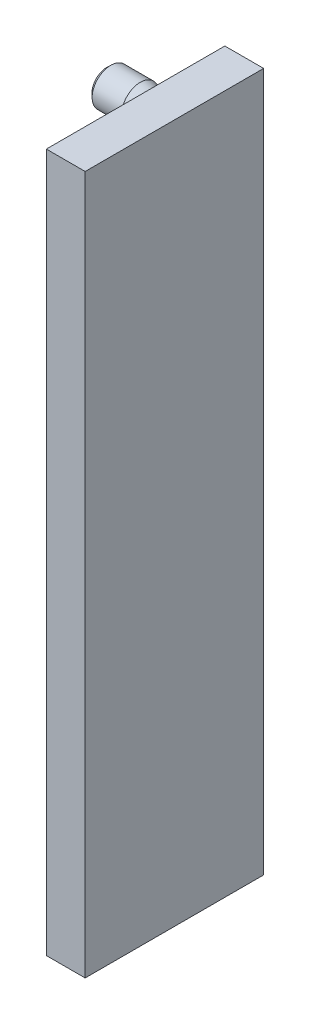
ISO-10303-21;
HEADER;
FILE_DESCRIPTION(('STEP AP214'),'2;1');
FILE_NAME('part.step','',(''),(''),'','','');
FILE_SCHEMA(('AUTOMOTIVE_DESIGN { 1 0 10303 214 1 1 1 1 }'));
ENDSEC;
DATA;
#1=APPLICATION_CONTEXT('core data for automotive mechanical design processes');
#2=APPLICATION_PROTOCOL_DEFINITION('international standard','automotive_design',2000,#1);
#3=PRODUCT_CONTEXT('',#1,'mechanical');
#4=PRODUCT('Part','Part','',(#3));
#5=PRODUCT_RELATED_PRODUCT_CATEGORY('part','',(#4));
#6=PRODUCT_DEFINITION_FORMATION('','',#4);
#7=PRODUCT_DEFINITION_CONTEXT('part definition',#1,'design');
#8=PRODUCT_DEFINITION('design','',#6,#7);
#9=PRODUCT_DEFINITION_SHAPE('','',#8);
#10=(LENGTH_UNIT() NAMED_UNIT(*) SI_UNIT(.MILLI.,.METRE.));
#11=(NAMED_UNIT(*) PLANE_ANGLE_UNIT() SI_UNIT($,.RADIAN.));
#12=(NAMED_UNIT(*) SI_UNIT($,.STERADIAN.) SOLID_ANGLE_UNIT());
#13=UNCERTAINTY_MEASURE_WITH_UNIT(LENGTH_MEASURE(1.E-05),#10,'distance_accuracy_value','');
#14=(GEOMETRIC_REPRESENTATION_CONTEXT(3) GLOBAL_UNCERTAINTY_ASSIGNED_CONTEXT((#13)) GLOBAL_UNIT_ASSIGNED_CONTEXT((#10,
#11,#12)) REPRESENTATION_CONTEXT('',''));
#15=CARTESIAN_POINT('',(0.,0.,0.));
#16=DIRECTION('',(0.,0.,1.));
#17=DIRECTION('',(1.,0.,0.));
#18=AXIS2_PLACEMENT_3D('',#15,#16,#17);
#19=CARTESIAN_POINT('',(-18.6839446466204,35.,1.9002106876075));
#20=DIRECTION('',(1.,0.,0.));
#21=DIRECTION('',(0.,1.,0.));
#22=AXIS2_PLACEMENT_3D('',#19,#20,#21);
#23=CONICAL_SURFACE('',#22,1.34162516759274,0.991977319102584);
#24=CARTESIAN_POINT('',(-18.6839446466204,35.,1.9002106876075));
#25=DIRECTION('',(1.,0.,0.));
#26=DIRECTION('',(0.,1.,0.));
#27=AXIS2_PLACEMENT_3D('',#24,#25,#26);
#28=CIRCLE('',#27,1.34162516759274);
#29=CARTESIAN_POINT('',(-18.6839446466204,36.3416251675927,1.9002106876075));
#30=VERTEX_POINT('',#29);
#31=EDGE_CURVE('E380',#30,#30,#28,.T.);
#32=ORIENTED_EDGE('',*,*,#31,.T.);
#33=EDGE_LOOP('',(#32));
#34=FACE_BOUND('',#33,.T.);
#35=CARTESIAN_POINT('',(-15.1519110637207,28.5265609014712,0.));
#36=CARTESIAN_POINT('',(-15.2544568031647,28.6901191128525,0.));
#37=CARTESIAN_POINT('',(-15.3567945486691,28.8538083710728,0.));
#38=CARTESIAN_POINT('',(-15.5609170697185,29.1815403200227,0.));
#39=CARTESIAN_POINT('',(-15.6627018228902,29.3455830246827,0.));
#40=CARTESIAN_POINT('',(-15.8657664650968,29.6744131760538,0.));
#41=CARTESIAN_POINT('',(-15.9670450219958,29.839201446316,0.));
#42=CARTESIAN_POINT('',(-16.1686855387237,30.1693317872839,0.));
#43=CARTESIAN_POINT('',(-16.2690475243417,30.3346738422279,0.));
#44=CARTESIAN_POINT('',(-16.4827361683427,30.6896316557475,0.));
#45=CARTESIAN_POINT('',(-16.5958788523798,30.8793584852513,0.));
#46=CARTESIAN_POINT('',(-16.8199167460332,31.2601620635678,0.));
#47=CARTESIAN_POINT('',(-16.9308117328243,31.45123894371,0.));
#48=CARTESIAN_POINT('',(-17.1491405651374,31.8351309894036,0.));
#49=CARTESIAN_POINT('',(-17.256577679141,32.0279442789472,0.));
#50=CARTESIAN_POINT('',(-17.4137169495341,32.3193144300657,0.));
#51=CARTESIAN_POINT('',(-17.4654235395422,32.4167887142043,0.));
#52=CARTESIAN_POINT('',(-17.5670981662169,32.6126378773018,0.));
#53=CARTESIAN_POINT('',(-17.6170662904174,32.7110127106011,0.));
#54=CARTESIAN_POINT('',(-17.7049791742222,32.8891261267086,0.));
#55=CARTESIAN_POINT('',(-17.7433321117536,32.9686627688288,0.));
#56=CARTESIAN_POINT('',(-17.818210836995,33.128597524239,0.));
#57=CARTESIAN_POINT('',(-17.8547365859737,33.2089956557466,0.));
#58=CARTESIAN_POINT('',(-17.9255155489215,33.3709076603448,0.));
#59=CARTESIAN_POINT('',(-17.9597659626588,33.4524227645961,0.));
#60=CARTESIAN_POINT('',(-18.0253036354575,33.6166444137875,0.));
#61=CARTESIAN_POINT('',(-18.0565909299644,33.6993509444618,0.));
#62=CARTESIAN_POINT('',(-18.1142915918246,33.8630449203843,0.));
#63=CARTESIAN_POINT('',(-18.1408419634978,33.9439835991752,0.));
#64=CARTESIAN_POINT('',(-18.1895109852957,34.1072073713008,0.));
#65=CARTESIAN_POINT('',(-18.211629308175,34.189492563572,0.));
#66=CARTESIAN_POINT('',(-18.2503349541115,34.3551459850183,0.));
#67=CARTESIAN_POINT('',(-18.2669367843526,34.4385107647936,0.));
#68=CARTESIAN_POINT('',(-18.2936529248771,34.6062533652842,0.));
#69=CARTESIAN_POINT('',(-18.3037705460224,34.6906306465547,0.));
#70=CARTESIAN_POINT('',(-18.3165443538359,34.8570999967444,0.));
#71=CARTESIAN_POINT('',(-18.3194404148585,34.9391732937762,0.));
#72=CARTESIAN_POINT('',(-18.3182429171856,35.1032861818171,0.));
#73=CARTESIAN_POINT('',(-18.3141477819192,35.1853257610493,0.));
#74=CARTESIAN_POINT('',(-18.2991464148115,35.3502984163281,0.));
#75=CARTESIAN_POINT('',(-18.2881155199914,35.4332199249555,0.));
#76=CARTESIAN_POINT('',(-18.259925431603,35.597965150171,0.));
#77=CARTESIAN_POINT('',(-18.2427679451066,35.6797891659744,0.));
#78=CARTESIAN_POINT('',(-18.1895405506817,35.8989115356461,0.));
#79=CARTESIAN_POINT('',(-18.1486323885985,36.0350261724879,0.));
#80=CARTESIAN_POINT('',(-18.0565914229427,36.3038052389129,0.));
#81=CARTESIAN_POINT('',(-18.0054451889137,36.4364648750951,0.));
#82=CARTESIAN_POINT('',(-17.89595613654,36.6997303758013,0.));
#83=CARTESIAN_POINT('',(-17.8375695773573,36.8303177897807,0.));
#84=CARTESIAN_POINT('',(-17.716115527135,37.0891883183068,0.));
#85=CARTESIAN_POINT('',(-17.6530504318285,37.2174725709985,0.));
#86=CARTESIAN_POINT('',(-17.5274938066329,37.4647652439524,0.));
#87=CARTESIAN_POINT('',(-17.4651921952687,37.5838707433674,0.));
#88=CARTESIAN_POINT('',(-17.3384536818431,37.8209571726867,0.));
#89=CARTESIAN_POINT('',(-17.2740164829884,37.9389379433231,0.));
#90=CARTESIAN_POINT('',(-17.144474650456,38.172361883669,0.));
#91=CARTESIAN_POINT('',(-17.0793921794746,38.2878173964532,0.));
#92=CARTESIAN_POINT('',(-16.948041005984,38.5180120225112,0.));
#93=CARTESIAN_POINT('',(-16.8817726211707,38.6327513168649,0.));
#94=CARTESIAN_POINT('',(-16.8150715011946,38.7472339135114,0.));
#95=B_SPLINE_CURVE_WITH_KNOTS('',3,(#35,#36,#37,#38,#39,#40,#41,#42,#43,#44,#45,#46,#47,#48,#49,
#50,#51,#52,#53,#54,#55,#56,#57,#58,#59,#60,#61,#62,#63,#64,#65,#66,#67,#68,#69,#70,#71,#72,#73,
#74,#75,#76,#77,#78,#79,#80,#81,#82,#83,#84,#85,#86,#87,#88,#89,#90,#91,#92,#93,#94),
.UNSPECIFIED.,.F.,.F.,(4,2,2,2,2,2,2,2,2,2,2,2,2,2,2,2,2,2,2,2,2,2,2,2,2,2,2,2,2,4),(0.,
0.579139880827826,1.15830302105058,1.73857010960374,2.31882082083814,2.98151411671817,
3.64427279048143,4.30638541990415,4.6373915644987,4.96838101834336,5.23326542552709,
5.49815544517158,5.76336564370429,6.02857266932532,6.2840186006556,6.5394833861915,
6.79427093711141,7.0489282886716,7.29500689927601,7.54114100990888,7.7918307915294,
8.04245077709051,8.46817320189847,8.89445779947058,9.32345613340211,9.75223628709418,
10.155455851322,10.5587316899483,10.9563309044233,11.3538251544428),.UNSPECIFIED.);
#96=CARTESIAN_POINT('',(-18.3067449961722,34.7332646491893,0.));
#97=VERTEX_POINT('',#96);
#98=CARTESIAN_POINT('',(-18.3067449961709,35.2667353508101,0.));
#99=VERTEX_POINT('',#98);
#100=EDGE_CURVE('E315',#97,#99,#95,.T.);
#101=ORIENTED_EDGE('',*,*,#100,.F.);
#102=CARTESIAN_POINT('',(-18.3067449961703,35.,1.9002106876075));
#103=DIRECTION('',(1.,0.,0.));
#104=DIRECTION('',(0.,1.,0.));
#105=AXIS2_PLACEMENT_3D('',#102,#103,#104);
#106=CIRCLE('',#105,1.91884038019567);
#107=EDGE_CURVE('E458',#99,#97,#106,.T.);
#108=ORIENTED_EDGE('',*,*,#107,.F.);
#109=EDGE_LOOP('',(#101,#108));
#110=FACE_BOUND('',#109,.T.);
#111=ADVANCED_FACE('F16',(#34,#110),#23,.T.);
#112=CARTESIAN_POINT('',(-18.3067449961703,35.,1.9002106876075));
#113=DIRECTION('',(1.,0.,0.));
#114=DIRECTION('',(0.,1.,0.));
#115=AXIS2_PLACEMENT_3D('',#112,#113,#114);
#116=CONICAL_SURFACE('',#115,1.91884038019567,0.760039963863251);
#117=CARTESIAN_POINT('',(-15.8429668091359,31.1864695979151,0.));
#118=CARTESIAN_POINT('',(-15.9244437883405,31.2730101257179,0.));
#119=CARTESIAN_POINT('',(-16.0056415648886,31.3598158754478,0.));
#120=CARTESIAN_POINT('',(-16.1673305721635,31.5340976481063,0.));
#121=CARTESIAN_POINT('',(-16.2478217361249,31.6215737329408,0.));
#122=CARTESIAN_POINT('',(-16.408238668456,31.7976541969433,0.));
#123=CARTESIAN_POINT('',(-16.4881611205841,31.8862616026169,0.));
#124=CARTESIAN_POINT('',(-16.646902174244,32.0644545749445,0.));
#125=CARTESIAN_POINT('',(-16.7257208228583,32.1540400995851,0.));
#126=CARTESIAN_POINT('',(-16.8862389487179,32.3393719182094,0.));
#127=CARTESIAN_POINT('',(-16.9678595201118,32.4351867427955,0.));
#128=CARTESIAN_POINT('',(-17.1290378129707,32.6285344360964,0.));
#129=CARTESIAN_POINT('',(-17.2085956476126,32.7260672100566,0.));
#130=CARTESIAN_POINT('',(-17.364794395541,32.9232069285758,0.));
#131=CARTESIAN_POINT('',(-17.4414396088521,33.0228104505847,0.));
#132=CARTESIAN_POINT('',(-17.5908182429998,33.2248944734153,0.));
#133=CARTESIAN_POINT('',(-17.6635528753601,33.3273740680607,0.));
#134=CARTESIAN_POINT('',(-17.7826268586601,33.5052016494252,0.));
#135=CARTESIAN_POINT('',(-17.8303984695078,33.5795855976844,0.));
#136=CARTESIAN_POINT('',(-17.9222269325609,33.7306698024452,0.));
#137=CARTESIAN_POINT('',(-17.9662824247,33.8073708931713,0.));
#138=CARTESIAN_POINT('',(-18.0490653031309,33.9629041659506,0.));
#139=CARTESIAN_POINT('',(-18.0878300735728,34.0417161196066,0.));
#140=CARTESIAN_POINT('',(-18.1586730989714,34.2022432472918,0.));
#141=CARTESIAN_POINT('',(-18.190756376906,34.2839561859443,0.));
#142=CARTESIAN_POINT('',(-18.2533239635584,34.4723128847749,0.));
#143=CARTESIAN_POINT('',(-18.2811927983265,34.5798850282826,0.));
#144=CARTESIAN_POINT('',(-18.3089967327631,34.7434003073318,0.));
#145=CARTESIAN_POINT('',(-18.3159315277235,34.798187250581,0.));
#146=CARTESIAN_POINT('',(-18.324840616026,34.9081757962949,0.));
#147=CARTESIAN_POINT('',(-18.326815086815,34.9633773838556,0.));
#148=CARTESIAN_POINT('',(-18.3256816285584,35.0738599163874,0.));
#149=CARTESIAN_POINT('',(-18.3225613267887,35.1291407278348,0.));
#150=CARTESIAN_POINT('',(-18.3113924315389,35.2391974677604,0.));
#151=CARTESIAN_POINT('',(-18.303343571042,35.2939733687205,0.));
#152=CARTESIAN_POINT('',(-18.2826932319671,35.4028484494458,0.));
#153=CARTESIAN_POINT('',(-18.270075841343,35.4569445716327,0.));
#154=CARTESIAN_POINT('',(-18.2408458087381,35.5640343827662,0.));
#155=CARTESIAN_POINT('',(-18.224232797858,35.6170279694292,0.));
#156=CARTESIAN_POINT('',(-18.1667947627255,35.7813574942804,0.));
#157=CARTESIAN_POINT('',(-18.1199051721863,35.8905765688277,0.));
#158=CARTESIAN_POINT('',(-18.0156353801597,36.1038986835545,0.));
#159=CARTESIAN_POINT('',(-17.9582363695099,36.2079921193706,0.));
#160=CARTESIAN_POINT('',(-17.8355616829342,36.4134254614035,0.));
#161=CARTESIAN_POINT('',(-17.7701841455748,36.5147038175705,0.));
#162=CARTESIAN_POINT('',(-17.6684658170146,36.6640273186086,0.));
#163=CARTESIAN_POINT('',(-17.6339650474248,36.7133509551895,0.));
#164=CARTESIAN_POINT('',(-17.5639258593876,36.8112544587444,0.));
#165=CARTESIAN_POINT('',(-17.5283874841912,36.8598343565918,0.));
#166=CARTESIAN_POINT('',(-17.4096284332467,37.0191562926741,0.));
#167=CARTESIAN_POINT('',(-17.3245485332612,37.1285116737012,0.));
#168=CARTESIAN_POINT('',(-17.1512190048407,37.3446893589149,0.));
#169=CARTESIAN_POINT('',(-17.0629687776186,37.4515111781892,0.));
#170=CARTESIAN_POINT('',(-16.8841368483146,37.6632835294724,0.));
#171=CARTESIAN_POINT('',(-16.7935538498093,37.7682329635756,0.));
#172=CARTESIAN_POINT('',(-16.6106853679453,37.976640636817,0.));
#173=CARTESIAN_POINT('',(-16.5183998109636,38.080098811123,0.));
#174=CARTESIAN_POINT('',(-16.2391326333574,38.38927755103,0.));
#175=CARTESIAN_POINT('',(-16.0502163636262,38.5932483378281,0.));
#176=CARTESIAN_POINT('',(-15.6692973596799,38.9981339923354,0.));
#177=CARTESIAN_POINT('',(-15.4772957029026,39.1990498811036,0.));
#178=CARTESIAN_POINT('',(-15.1148034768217,39.5743776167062,0.));
#179=CARTESIAN_POINT('',(-14.9445556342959,39.7490242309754,0.));
#180=CARTESIAN_POINT('',(-14.6028571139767,40.097170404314,0.));
#181=CARTESIAN_POINT('',(-14.4314063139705,40.2706698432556,0.));
#182=CARTESIAN_POINT('',(-14.0884730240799,40.6159275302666,0.));
#183=CARTESIAN_POINT('',(-13.9169949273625,40.7876901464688,0.));
#184=CARTESIAN_POINT('',(-13.5733724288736,41.1305054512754,0.));
#185=CARTESIAN_POINT('',(-13.4012281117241,41.3015582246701,0.));
#186=CARTESIAN_POINT('',(-13.2288350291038,41.4723583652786,0.));
#187=B_SPLINE_CURVE_WITH_KNOTS('',3,(#117,#118,#119,#120,#121,#122,#123,#124,#125,#126,#127,
#128,#129,#130,#131,#132,#133,#134,#135,#136,#137,#138,#139,#140,#141,#142,#143,#144,#145,#146,
#147,#148,#149,#150,#151,#152,#153,#154,#155,#156,#157,#158,#159,#160,#161,#162,#163,#164,#165,
#166,#167,#168,#169,#170,#171,#172,#173,#174,#175,#176,#177,#178,#179,#180,#181,#182,#183,#184,
#185,#186),.UNSPECIFIED.,.F.,.F.,(4,2,2,2,2,2,2,2,2,2,2,2,2,2,2,2,2,2,2,2,2,2,2,2,2,2,2,2,2,2,2,
2,2,2,4),(0.,0.356582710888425,0.71319875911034,1.07117159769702,1.42912912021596,
1.80670766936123,2.18426545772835,2.5612422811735,2.9381016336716,3.2032294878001,
3.46845395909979,3.73169484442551,3.99473711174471,4.32661381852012,4.49209268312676,
4.65756562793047,4.82344102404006,4.98932540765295,5.15579320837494,5.32227638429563,
5.67789990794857,6.03416624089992,6.39558226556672,6.57615103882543,6.75671229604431,
7.17227707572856,7.58792076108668,8.00380064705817,8.41969855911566,9.25368457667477,
10.0873854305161,10.8190687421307,11.5508274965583,12.2789491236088,13.0069811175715),.UNSPECIFIED.);
#188=CARTESIAN_POINT('',(-17.8004213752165,33.5337970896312,0.));
#189=VERTEX_POINT('',#188);
#190=EDGE_CURVE('E314',#189,#97,#187,.T.);
#191=ORIENTED_EDGE('',*,*,#190,.F.);
#192=CARTESIAN_POINT('',(-17.8004213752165,35.,1.9002106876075));
#193=DIRECTION('',(1.,0.,0.));
#194=DIRECTION('',(0.,1.,0.));
#195=AXIS2_PLACEMENT_3D('',#192,#193,#194);
#196=CIRCLE('',#195,2.40011492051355);
#197=CARTESIAN_POINT('',(-17.8004213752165,36.4662029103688,0.));
#198=VERTEX_POINT('',#197);
#199=EDGE_CURVE('E455',#198,#189,#196,.T.);
#200=ORIENTED_EDGE('',*,*,#199,.F.);
#201=EDGE_CURVE('E307',#99,#198,#187,.T.);
#202=ORIENTED_EDGE('',*,*,#201,.F.);
#203=ORIENTED_EDGE('',*,*,#107,.T.);
#204=EDGE_LOOP('',(#191,#200,#202,#203));
#205=FACE_BOUND('',#204,.T.);
#206=ADVANCED_FACE('F322',(#205),#116,.T.);
#207=CARTESIAN_POINT('',(-5.,35.,1.9002106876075));
#208=DIRECTION('',(1.,0.,0.));
#209=DIRECTION('',(0.,1.,0.));
#210=AXIS2_PLACEMENT_3D('',#207,#208,#209);
#211=CYLINDRICAL_SURFACE('',#210,2.40011492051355);
#212=DIRECTION('',(1.,0.,0.));
#213=VECTOR('',#212,1.);
#214=CARTESIAN_POINT('',(-5.,36.4662029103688,0.));
#215=LINE('',#214,#213);
#216=CARTESIAN_POINT('',(-14.0005746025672,36.4662029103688,0.));
#217=VERTEX_POINT('',#216);
#218=EDGE_CURVE('E37',#198,#217,#215,.T.);
#219=ORIENTED_EDGE('',*,*,#218,.F.);
#220=ORIENTED_EDGE('',*,*,#199,.T.);
#221=DIRECTION('',(1.,0.,0.));
#222=VECTOR('',#221,1.);
#223=CARTESIAN_POINT('',(-5.,33.5337970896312,0.));
#224=LINE('',#223,#222);
#225=CARTESIAN_POINT('',(-14.0005746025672,33.5337970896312,0.));
#226=VERTEX_POINT('',#225);
#227=EDGE_CURVE('E411',#226,#189,#224,.F.);
#228=ORIENTED_EDGE('',*,*,#227,.F.);
#229=CARTESIAN_POINT('',(-14.0005746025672,35.,1.9002106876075));
#230=DIRECTION('',(1.,0.,0.));
#231=DIRECTION('',(0.,1.,0.));
#232=AXIS2_PLACEMENT_3D('',#229,#230,#231);
#233=CIRCLE('',#232,2.40011492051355);
#234=EDGE_CURVE('E452',#217,#226,#233,.T.);
#235=ORIENTED_EDGE('',*,*,#234,.F.);
#236=EDGE_LOOP('',(#219,#220,#228,#235));
#237=FACE_BOUND('',#236,.T.);
#238=ADVANCED_FACE('F326',(#237),#211,.T.);
#239=CARTESIAN_POINT('',(-14.0005746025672,35.,1.9002106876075));
#240=DIRECTION('',(-1.,0.,0.));
#241=DIRECTION('',(0.,-1.,0.));
#242=AXIS2_PLACEMENT_3D('',#239,#240,#241);
#243=CONICAL_SURFACE('',#242,2.40011492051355,0.261760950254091);
#244=CARTESIAN_POINT('',(-11.3775138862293,35.,1.9002106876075));
#245=DIRECTION('',(1.,0.,0.));
#246=DIRECTION('',(0.,1.,0.));
#247=AXIS2_PLACEMENT_3D('',#244,#245,#246);
#248=CIRCLE('',#247,1.69737598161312);
#249=CARTESIAN_POINT('',(-11.3775138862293,36.6973759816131,1.9002106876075));
#250=VERTEX_POINT('',#249);
#251=EDGE_CURVE('E449',#250,#250,#248,.T.);
#252=ORIENTED_EDGE('',*,*,#251,.F.);
#253=EDGE_LOOP('',(#252));
#254=FACE_BOUND('',#253,.T.);
#255=CARTESIAN_POINT('',(-16.9489185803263,32.4377161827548,0.));
#256=CARTESIAN_POINT('',(-16.805299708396,32.4856277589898,0.));
#257=CARTESIAN_POINT('',(-16.6618174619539,32.5339535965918,0.));
#258=CARTESIAN_POINT('',(-16.375190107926,32.6316250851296,0.));
#259=CARTESIAN_POINT('',(-16.2320450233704,32.6809708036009,0.));
#260=CARTESIAN_POINT('',(-15.945840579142,32.7809838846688,0.));
#261=CARTESIAN_POINT('',(-15.8027822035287,32.8316540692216,0.));
#262=CARTESIAN_POINT('',(-15.5171990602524,32.9344652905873,0.));
#263=CARTESIAN_POINT('',(-15.3746742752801,32.9866062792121,0.));
#264=CARTESIAN_POINT('',(-15.0903534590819,33.0926896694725,0.));
#265=CARTESIAN_POINT('',(-14.948557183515,33.1466314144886,0.));
#266=CARTESIAN_POINT('',(-14.6658617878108,33.2568144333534,0.));
#267=CARTESIAN_POINT('',(-14.5249626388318,33.3130556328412,0.));
#268=CARTESIAN_POINT('',(-14.2445230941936,33.4284834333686,0.));
#269=CARTESIAN_POINT('',(-14.1049815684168,33.4876672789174,0.));
#270=CARTESIAN_POINT('',(-13.8276830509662,33.6100585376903,0.));
#271=CARTESIAN_POINT('',(-13.6899256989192,33.67326512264,0.));
#272=CARTESIAN_POINT('',(-13.5019114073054,33.7643878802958,0.));
#273=CARTESIAN_POINT('',(-13.4504591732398,33.789835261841,0.));
#274=CARTESIAN_POINT('',(-13.3480488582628,33.8417108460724,0.));
#275=CARTESIAN_POINT('',(-13.2970908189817,33.8681391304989,0.));
#276=CARTESIAN_POINT('',(-13.1448063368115,33.9492876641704,0.));
#277=CARTESIAN_POINT('',(-13.0443691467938,34.0057287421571,0.));
#278=CARTESIAN_POINT('',(-12.8970267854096,34.095193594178,0.));
#279=CARTESIAN_POINT('',(-12.8486046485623,34.1257174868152,0.));
#280=CARTESIAN_POINT('',(-12.7531191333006,34.1888121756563,0.));
#281=CARTESIAN_POINT('',(-12.7060553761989,34.2213823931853,0.));
#282=CARTESIAN_POINT('',(-12.6139846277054,34.2889782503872,0.));
#283=CARTESIAN_POINT('',(-12.5689705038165,34.3239940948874,0.));
#284=CARTESIAN_POINT('',(-12.4817133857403,34.3972933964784,0.));
#285=CARTESIAN_POINT('',(-12.4394671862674,34.4355729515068,0.));
#286=CARTESIAN_POINT('',(-12.3706621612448,34.5049212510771,0.));
#287=CARTESIAN_POINT('',(-12.3430593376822,34.5349437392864,0.));
#288=CARTESIAN_POINT('',(-12.2909410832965,34.5976912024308,0.));
#289=CARTESIAN_POINT('',(-12.266430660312,34.6304204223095,0.));
#290=CARTESIAN_POINT('',(-12.2216794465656,34.6994074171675,0.));
#291=CARTESIAN_POINT('',(-12.2015026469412,34.7357078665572,0.));
#292=CARTESIAN_POINT('',(-12.1681225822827,34.8113664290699,0.));
#293=CARTESIAN_POINT('',(-12.1548910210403,34.8507113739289,0.));
#294=CARTESIAN_POINT('',(-12.1401198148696,34.9198153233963,0.));
#295=CARTESIAN_POINT('',(-12.136315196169,34.9490870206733,0.));
#296=CARTESIAN_POINT('',(-12.1338345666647,35.007857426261,0.));
#297=CARTESIAN_POINT('',(-12.1351581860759,35.0373561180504,0.));
#298=CARTESIAN_POINT('',(-12.1427587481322,35.0955935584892,0.));
#299=CARTESIAN_POINT('',(-12.1490203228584,35.1243343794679,0.));
#300=CARTESIAN_POINT('',(-12.1657871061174,35.1805268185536,0.));
#301=CARTESIAN_POINT('',(-12.1762945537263,35.2079777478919,0.));
#302=CARTESIAN_POINT('',(-12.2085386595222,35.278477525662,0.));
#303=CARTESIAN_POINT('',(-12.2331503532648,35.3201972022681,0.));
#304=CARTESIAN_POINT('',(-12.2882616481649,35.399573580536,0.));
#305=CARTESIAN_POINT('',(-12.3187845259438,35.4372132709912,0.));
#306=CARTESIAN_POINT('',(-12.39551891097,35.5223080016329,0.));
#307=CARTESIAN_POINT('',(-12.443365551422,35.5682652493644,0.));
#308=CARTESIAN_POINT('',(-12.5431923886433,35.655510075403,0.));
#309=CARTESIAN_POINT('',(-12.595181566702,35.6967870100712,0.));
#310=CARTESIAN_POINT('',(-12.7024179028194,35.7762983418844,0.));
#311=CARTESIAN_POINT('',(-12.7576975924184,35.8144884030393,0.));
#312=CARTESIAN_POINT('',(-12.8699810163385,35.888061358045,0.));
#313=CARTESIAN_POINT('',(-12.9269826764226,35.923447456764,0.));
#314=CARTESIAN_POINT('',(-13.052068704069,35.9979044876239,0.));
#315=CARTESIAN_POINT('',(-13.1203884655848,36.0365778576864,0.));
#316=CARTESIAN_POINT('',(-13.2582754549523,36.1116425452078,0.));
#317=CARTESIAN_POINT('',(-13.3278429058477,36.1480334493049,0.));
#318=CARTESIAN_POINT('',(-13.5380001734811,36.2545488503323,0.));
#319=CARTESIAN_POINT('',(-13.6799587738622,36.3219666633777,0.));
#320=CARTESIAN_POINT('',(-13.9665614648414,36.4521837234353,0.));
#321=CARTESIAN_POINT('',(-14.1112134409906,36.5149652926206,0.));
#322=CARTESIAN_POINT('',(-14.4019392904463,36.6369726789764,0.));
#323=CARTESIAN_POINT('',(-14.5480126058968,36.6961998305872,0.));
#324=CARTESIAN_POINT('',(-14.8240709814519,36.8052321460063,0.));
#325=CARTESIAN_POINT('',(-14.9539413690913,36.8553295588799,0.));
#326=CARTESIAN_POINT('',(-15.2143243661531,36.9538693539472,0.));
#327=CARTESIAN_POINT('',(-15.3448370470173,37.0023115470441,0.));
#328=CARTESIAN_POINT('',(-15.6054210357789,37.0975020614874,0.));
#329=CARTESIAN_POINT('',(-15.7354888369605,37.1442600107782,0.));
#330=CARTESIAN_POINT('',(-15.9959998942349,37.2366487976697,0.));
#331=CARTESIAN_POINT('',(-16.1264430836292,37.2822798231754,0.));
#332=CARTESIAN_POINT('',(-16.2570407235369,37.3274583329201,0.));
#333=B_SPLINE_CURVE_WITH_KNOTS('',3,(#255,#256,#257,#258,#259,#260,#261,#262,#263,#264,#265,
#266,#267,#268,#269,#270,#271,#272,#273,#274,#275,#276,#277,#278,#279,#280,#281,#282,#283,#284,
#285,#286,#287,#288,#289,#290,#291,#292,#293,#294,#295,#296,#297,#298,#299,#300,#301,#302,#303,
#304,#305,#306,#307,#308,#309,#310,#311,#312,#313,#314,#315,#316,#317,#318,#319,#320,#321,#322,
#323,#324,#325,#326,#327,#328,#329,#330,#331,#332),.UNSPECIFIED.,.F.,.F.,(4,2,2,2,2,2,2,2,2,2,2,
2,2,2,2,2,2,2,2,2,2,2,2,2,2,2,2,2,2,2,2,2,2,2,2,2,2,2,4),(0.,0.454201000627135,
0.908432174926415,1.36372604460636,1.81900501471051,2.27411974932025,2.7292197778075,
3.18390139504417,3.63848969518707,3.81068310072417,3.98289088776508,4.32830172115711,
4.49998452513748,4.67161899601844,4.84260162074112,5.01338261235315,5.13558373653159,
5.2579802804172,5.38207585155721,5.50566183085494,5.59380081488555,5.68193344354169,
5.76979286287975,5.85769867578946,6.00216838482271,6.14721898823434,6.34574962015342,
6.54472304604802,6.74617654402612,6.94739636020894,7.18285547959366,7.4183571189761,
7.88965781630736,8.36267155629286,8.83550658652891,9.25308792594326,9.67071681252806,
10.0853624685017,10.4999385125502),.UNSPECIFIED.);
#334=EDGE_CURVE('E299',#217,#226,#333,.F.);
#335=ORIENTED_EDGE('',*,*,#334,.F.);
#336=ORIENTED_EDGE('',*,*,#234,.T.);
#337=EDGE_LOOP('',(#335,#336));
#338=FACE_BOUND('',#337,.T.);
#339=ADVANCED_FACE('F476',(#254,#338),#243,.T.);
#340=CARTESIAN_POINT('',(-11.0235946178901,35.,1.9002106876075));
#341=DIRECTION('',(1.,0.,0.));
#342=DIRECTION('',(0.,1.,0.));
#343=AXIS2_PLACEMENT_3D('',#340,#341,#342);
#344=CONICAL_SURFACE('',#343,1.8702954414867,1.37127084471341);
#345=CARTESIAN_POINT('',(-11.0235946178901,35.,1.9002106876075));
#346=DIRECTION('',(1.,0.,0.));
#347=DIRECTION('',(0.,1.,0.));
#348=AXIS2_PLACEMENT_3D('',#345,#346,#347);
#349=CIRCLE('',#348,1.8702954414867);
#350=CARTESIAN_POINT('',(-11.0235946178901,36.8702954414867,1.9002106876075));
#351=VERTEX_POINT('',#350);
#352=EDGE_CURVE('E437',#351,#351,#349,.T.);
#353=ORIENTED_EDGE('',*,*,#352,.T.);
#354=EDGE_LOOP('',(#353));
#355=FACE_BOUND('',#354,.T.);
#356=CARTESIAN_POINT('',(-10.7191820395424,32.2099457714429,0.));
#357=CARTESIAN_POINT('',(-10.7334018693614,32.2950400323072,0.));
#358=CARTESIAN_POINT('',(-10.7474262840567,32.3801669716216,0.));
#359=CARTESIAN_POINT('',(-10.7749866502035,32.5505023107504,0.));
#360=CARTESIAN_POINT('',(-10.7885225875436,32.6357107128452,0.));
#361=CARTESIAN_POINT('',(-10.828273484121,32.8916260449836,0.));
#362=CARTESIAN_POINT('',(-10.8536059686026,33.0624722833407,0.));
#363=CARTESIAN_POINT('',(-10.9005637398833,33.4035377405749,0.));
#364=CARTESIAN_POINT('',(-10.9222123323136,33.5737536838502,0.));
#365=CARTESIAN_POINT('',(-10.9602262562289,33.9147313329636,0.));
#366=CARTESIAN_POINT('',(-10.9765935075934,34.0854928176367,0.));
#367=CARTESIAN_POINT('',(-11.0018336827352,34.4284508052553,0.));
#368=CARTESIAN_POINT('',(-11.010669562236,34.6006502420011,0.));
#369=CARTESIAN_POINT('',(-11.0168839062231,34.8591291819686,0.));
#370=CARTESIAN_POINT('',(-11.0177817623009,34.9453301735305,0.));
#371=CARTESIAN_POINT('',(-11.0172030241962,35.1177225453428,0.));
#372=CARTESIAN_POINT('',(-11.0157264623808,35.2039139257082,0.));
#373=CARTESIAN_POINT('',(-11.0077980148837,35.4634017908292,0.));
#374=CARTESIAN_POINT('',(-10.9978238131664,35.6365982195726,0.));
#375=CARTESIAN_POINT('',(-10.9772868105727,35.8959206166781,0.));
#376=CARTESIAN_POINT('',(-10.9695109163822,35.98229039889,0.));
#377=CARTESIAN_POINT('',(-10.9524003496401,36.1548597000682,0.));
#378=CARTESIAN_POINT('',(-10.9430659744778,36.2410592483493,0.));
#379=CARTESIAN_POINT('',(-10.933100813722,36.3271863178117,0.));
#380=B_SPLINE_CURVE_WITH_KNOTS('',3,(#356,#357,#358,#359,#360,#361,#362,#363,#364,#365,#366,
#367,#368,#369,#370,#371,#372,#373,#374,#375,#376,#377,#378,#379),.UNSPECIFIED.,.F.,.F.,(4,2,2,
2,2,2,2,2,2,2,2,4),(0.,0.25882210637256,0.517651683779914,1.03576971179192,1.55047712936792,
2.06499722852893,2.58203371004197,2.84062016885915,3.09920310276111,3.61940692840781,
3.8795553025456,4.1396540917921),.UNSPECIFIED.);
#381=CARTESIAN_POINT('',(-11.0000000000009,34.4192490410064,0.));
#382=VERTEX_POINT('',#381);
#383=CARTESIAN_POINT('',(-11.0000000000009,35.5807509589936,0.));
#384=VERTEX_POINT('',#383);
#385=EDGE_CURVE('E277',#382,#384,#380,.T.);
#386=ORIENTED_EDGE('',*,*,#385,.F.);
#387=CARTESIAN_POINT('',(-11.0000000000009,35.,1.9002106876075));
#388=DIRECTION('',(1.,0.,0.));
#389=DIRECTION('',(0.,1.,0.));
#390=AXIS2_PLACEMENT_3D('',#387,#388,#389);
#391=CIRCLE('',#390,1.98697567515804);
#392=EDGE_CURVE('E430',#384,#382,#391,.T.);
#393=ORIENTED_EDGE('',*,*,#392,.F.);
#394=EDGE_LOOP('',(#386,#393));
#395=FACE_BOUND('',#394,.T.);
#396=ADVANCED_FACE('F478',(#355,#395),#344,.T.);
#397=CARTESIAN_POINT('',(-11.0000000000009,35.,3.88718636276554));
#398=DIRECTION('',(1.,0.,0.));
#399=DIRECTION('',(0.,1.,0.));
#400=AXIS2_PLACEMENT_3D('',#397,#398,#399);
#401=PLANE('',#400);
#402=DIRECTION('',(0.,1.,0.));
#403=VECTOR('',#402,1.);
#404=CARTESIAN_POINT('',(-11.0000000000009,35.,0.));
#405=LINE('',#404,#403);
#406=CARTESIAN_POINT('',(-11.0000000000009,33.7039228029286,0.));
#407=VERTEX_POINT('',#406);
#408=EDGE_CURVE('E413',#407,#382,#405,.T.);
#409=ORIENTED_EDGE('',*,*,#408,.F.);
#410=CARTESIAN_POINT('',(-11.0000000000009,35.,1.9002106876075));
#411=DIRECTION('',(1.,0.,0.));
#412=DIRECTION('',(0.,1.,0.));
#413=AXIS2_PLACEMENT_3D('',#410,#411,#412);
#414=CIRCLE('',#413,2.30013407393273);
#415=CARTESIAN_POINT('',(-11.0000000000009,36.2960771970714,0.));
#416=VERTEX_POINT('',#415);
#417=EDGE_CURVE('E428',#416,#407,#414,.T.);
#418=ORIENTED_EDGE('',*,*,#417,.F.);
#419=EDGE_CURVE('E415',#384,#416,#405,.T.);
#420=ORIENTED_EDGE('',*,*,#419,.F.);
#421=ORIENTED_EDGE('',*,*,#392,.T.);
#422=EDGE_LOOP('',(#409,#418,#420,#421));
#423=FACE_BOUND('',#422,.T.);
#424=ADVANCED_FACE('F485',(#423),#401,.F.);
#425=CARTESIAN_POINT('',(-11.0000000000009,35.,1.9002106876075));
#426=DIRECTION('',(1.,0.,0.));
#427=DIRECTION('',(0.,1.,0.));
#428=AXIS2_PLACEMENT_3D('',#425,#426,#427);
#429=CONICAL_SURFACE('',#428,2.30013407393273,0.785398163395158);
#430=CARTESIAN_POINT('',(-8.88399392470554,31.013586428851,0.));
#431=CARTESIAN_POINT('',(-8.96791943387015,31.106572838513,0.));
#432=CARTESIAN_POINT('',(-9.0515597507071,31.1998189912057,0.));
#433=CARTESIAN_POINT('',(-9.21811169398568,31.3869739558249,0.));
#434=CARTESIAN_POINT('',(-9.30102325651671,31.4808828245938,0.));
#435=CARTESIAN_POINT('',(-9.46614894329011,31.6697238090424,0.));
#436=CARTESIAN_POINT('',(-9.54836083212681,31.7646578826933,0.));
#437=CARTESIAN_POINT('',(-9.71163670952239,31.9555037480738,0.));
#438=CARTESIAN_POINT('',(-9.79270074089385,32.0514155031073,0.));
#439=CARTESIAN_POINT('',(-9.95192018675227,32.2427368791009,0.));
#440=CARTESIAN_POINT('',(-10.0301016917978,32.3381247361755,0.));
#441=CARTESIAN_POINT('',(-10.1846091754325,32.5303901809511,0.));
#442=CARTESIAN_POINT('',(-10.2609352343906,32.6272677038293,0.));
#443=CARTESIAN_POINT('',(-10.4110649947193,32.8228797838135,0.));
#444=CARTESIAN_POINT('',(-10.4848700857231,32.9216132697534,0.));
#445=CARTESIAN_POINT('',(-10.6290622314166,33.1215346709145,0.));
#446=CARTESIAN_POINT('',(-10.6994500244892,33.2227220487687,0.));
#447=CARTESIAN_POINT('',(-10.8218843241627,33.4079152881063,0.));
#448=CARTESIAN_POINT('',(-10.8747978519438,33.491343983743,0.));
#449=CARTESIAN_POINT('',(-10.9763413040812,33.6606701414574,0.));
#450=CARTESIAN_POINT('',(-11.0249756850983,33.74656490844,0.));
#451=CARTESIAN_POINT('',(-11.1167587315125,33.9220576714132,0.));
#452=CARTESIAN_POINT('',(-11.1598674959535,34.011677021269,0.));
#453=CARTESIAN_POINT('',(-11.2184381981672,34.1489010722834,0.));
#454=CARTESIAN_POINT('',(-11.2369737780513,34.1951928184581,0.));
#455=CARTESIAN_POINT('',(-11.271625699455,34.2887102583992,0.));
#456=CARTESIAN_POINT('',(-11.287740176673,34.3359366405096,0.));
#457=CARTESIAN_POINT('',(-11.3024541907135,34.3836200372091,0.));
#458=B_SPLINE_CURVE_WITH_KNOTS('',3,(#430,#431,#432,#433,#434,#435,#436,#437,#438,#439,#440,
#441,#442,#443,#444,#445,#446,#447,#448,#449,#450,#451,#452,#453,#454,#455,#456,#457),
.UNSPECIFIED.,.F.,.F.,(4,2,2,2,2,2,2,2,2,2,2,2,2,4),(0.,0.375780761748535,0.751594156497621,
1.12833815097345,1.5050680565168,1.87505179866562,2.2450194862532,2.61477983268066,
2.98445992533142,3.28074748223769,3.57672271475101,3.87472738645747,4.02426083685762,
4.17390884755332),.UNSPECIFIED.);
#459=CARTESIAN_POINT('',(-10.9000191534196,33.5337970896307,0.));
#460=VERTEX_POINT('',#459);
#461=EDGE_CURVE('E285',#460,#407,#458,.T.);
#462=ORIENTED_EDGE('',*,*,#461,.F.);
#463=CARTESIAN_POINT('',(-10.9000191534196,35.,1.9002106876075));
#464=DIRECTION('',(1.,0.,0.));
#465=DIRECTION('',(0.,1.,0.));
#466=AXIS2_PLACEMENT_3D('',#463,#464,#465);
#467=CIRCLE('',#466,2.40011492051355);
#468=CARTESIAN_POINT('',(-10.9000191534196,36.4662029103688,0.));
#469=VERTEX_POINT('',#468);
#470=EDGE_CURVE('E426',#469,#460,#467,.T.);
#471=ORIENTED_EDGE('',*,*,#470,.F.);
#472=CARTESIAN_POINT('',(-11.3024541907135,35.6163799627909,0.));
#473=CARTESIAN_POINT('',(-11.287740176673,35.6640633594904,0.));
#474=CARTESIAN_POINT('',(-11.271625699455,35.7112897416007,0.));
#475=CARTESIAN_POINT('',(-11.2369737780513,35.8048071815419,0.));
#476=CARTESIAN_POINT('',(-11.2184381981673,35.8510989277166,0.));
#477=CARTESIAN_POINT('',(-11.1598674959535,35.988322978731,0.));
#478=CARTESIAN_POINT('',(-11.1167587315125,36.0779423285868,0.));
#479=CARTESIAN_POINT('',(-11.0249756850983,36.25343509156,0.));
#480=CARTESIAN_POINT('',(-10.9763413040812,36.3393298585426,0.));
#481=CARTESIAN_POINT('',(-10.8747978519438,36.508656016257,0.));
#482=CARTESIAN_POINT('',(-10.8218843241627,36.5920847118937,0.));
#483=CARTESIAN_POINT('',(-10.6994500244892,36.7772779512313,0.));
#484=CARTESIAN_POINT('',(-10.6290622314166,36.8784653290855,0.));
#485=CARTESIAN_POINT('',(-10.4848700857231,37.0783867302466,0.));
#486=CARTESIAN_POINT('',(-10.4110649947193,37.1771202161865,0.));
#487=CARTESIAN_POINT('',(-10.2609352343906,37.3727322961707,0.));
#488=CARTESIAN_POINT('',(-10.1846091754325,37.4696098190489,0.));
#489=CARTESIAN_POINT('',(-10.0301016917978,37.6618752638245,0.));
#490=CARTESIAN_POINT('',(-9.95192018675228,37.7572631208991,0.));
#491=CARTESIAN_POINT('',(-9.79270074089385,37.9485844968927,0.));
#492=CARTESIAN_POINT('',(-9.7116367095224,38.0444962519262,0.));
#493=CARTESIAN_POINT('',(-9.54836083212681,38.2353421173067,0.));
#494=CARTESIAN_POINT('',(-9.46614894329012,38.3302761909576,0.));
#495=CARTESIAN_POINT('',(-9.30102325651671,38.5191171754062,0.));
#496=CARTESIAN_POINT('',(-9.21811169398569,38.6130260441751,0.));
#497=CARTESIAN_POINT('',(-9.0515597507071,38.8001810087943,0.));
#498=CARTESIAN_POINT('',(-8.96791943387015,38.893427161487,0.));
#499=CARTESIAN_POINT('',(-8.88399392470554,38.986413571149,0.));
#500=B_SPLINE_CURVE_WITH_KNOTS('',3,(#472,#473,#474,#475,#476,#477,#478,#479,#480,#481,#482,
#483,#484,#485,#486,#487,#488,#489,#490,#491,#492,#493,#494,#495,#496,#497,#498,#499),
.UNSPECIFIED.,.F.,.F.,(4,2,2,2,2,2,2,2,2,2,2,2,2,4),(0.,0.149648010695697,0.299181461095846,
0.597186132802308,0.893161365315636,1.1894489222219,1.55912901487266,1.92888936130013,
2.29885704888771,2.66884079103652,3.04557069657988,3.42231469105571,3.79812808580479,
4.17390884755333),.UNSPECIFIED.);
#501=EDGE_CURVE('E268',#416,#469,#500,.T.);
#502=ORIENTED_EDGE('',*,*,#501,.F.);
#503=ORIENTED_EDGE('',*,*,#417,.T.);
#504=EDGE_LOOP('',(#462,#471,#502,#503));
#505=FACE_BOUND('',#504,.T.);
#506=ADVANCED_FACE('F427',(#505),#429,.T.);
#507=CARTESIAN_POINT('',(-5.,35.,1.9002106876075));
#508=DIRECTION('',(1.,0.,0.));
#509=DIRECTION('',(0.,1.,0.));
#510=AXIS2_PLACEMENT_3D('',#507,#508,#509);
#511=CYLINDRICAL_SURFACE('',#510,2.40011492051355);
#512=DIRECTION('',(1.,0.,0.));
#513=VECTOR('',#512,1.);
#514=CARTESIAN_POINT('',(-5.,36.4662029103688,0.));
#515=LINE('',#514,#513);
#516=CARTESIAN_POINT('',(-5.09998084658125,36.4662029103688,0.));
#517=VERTEX_POINT('',#516);
#518=EDGE_CURVE('E45',#469,#517,#515,.T.);
#519=ORIENTED_EDGE('',*,*,#518,.F.);
#520=ORIENTED_EDGE('',*,*,#470,.T.);
#521=DIRECTION('',(1.,0.,0.));
#522=VECTOR('',#521,1.);
#523=CARTESIAN_POINT('',(-5.,33.5337970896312,0.));
#524=LINE('',#523,#522);
#525=CARTESIAN_POINT('',(-5.09998084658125,33.5337970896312,0.));
#526=VERTEX_POINT('',#525);
#527=EDGE_CURVE('E410',#526,#460,#524,.F.);
#528=ORIENTED_EDGE('',*,*,#527,.F.);
#529=CARTESIAN_POINT('',(-5.09998084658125,35.,1.9002106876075));
#530=DIRECTION('',(1.,0.,0.));
#531=DIRECTION('',(0.,1.,0.));
#532=AXIS2_PLACEMENT_3D('',#529,#530,#531);
#533=CIRCLE('',#532,2.40011492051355);
#534=EDGE_CURVE('E408',#517,#526,#533,.T.);
#535=ORIENTED_EDGE('',*,*,#534,.F.);
#536=EDGE_LOOP('',(#519,#520,#528,#535));
#537=FACE_BOUND('',#536,.T.);
#538=ADVANCED_FACE('F425',(#537),#511,.T.);
#539=CARTESIAN_POINT('',(-5.09998084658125,35.,1.9002106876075));
#540=DIRECTION('',(-1.,0.,0.));
#541=DIRECTION('',(0.,-1.,0.));
#542=AXIS2_PLACEMENT_3D('',#539,#540,#541);
#543=CONICAL_SURFACE('',#542,2.40011492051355,0.785398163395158);
#544=CARTESIAN_POINT('',(-4.69754580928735,34.3836200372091,0.));
#545=CARTESIAN_POINT('',(-4.71225982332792,34.3359366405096,0.));
#546=CARTESIAN_POINT('',(-4.72837430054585,34.2887102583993,0.));
#547=CARTESIAN_POINT('',(-4.76302622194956,34.1951928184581,0.));
#548=CARTESIAN_POINT('',(-4.78156180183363,34.1489010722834,0.));
#549=CARTESIAN_POINT('',(-4.84013250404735,34.011677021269,0.));
#550=CARTESIAN_POINT('',(-4.88324126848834,33.9220576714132,0.));
#551=CARTESIAN_POINT('',(-4.97502431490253,33.74656490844,0.));
#552=CARTESIAN_POINT('',(-5.0236586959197,33.6606701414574,0.));
#553=CARTESIAN_POINT('',(-5.12520214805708,33.491343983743,0.));
#554=CARTESIAN_POINT('',(-5.17811567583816,33.4079152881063,0.));
#555=CARTESIAN_POINT('',(-5.30054997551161,33.2227220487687,0.));
#556=CARTESIAN_POINT('',(-5.3709377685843,33.1215346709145,0.));
#557=CARTESIAN_POINT('',(-5.51512991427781,32.9216132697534,0.));
#558=CARTESIAN_POINT('',(-5.58893500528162,32.8228797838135,0.));
#559=CARTESIAN_POINT('',(-5.73906476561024,32.6272677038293,0.));
#560=CARTESIAN_POINT('',(-5.8153908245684,32.5303901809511,0.));
#561=CARTESIAN_POINT('',(-5.96989830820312,32.3381247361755,0.));
#562=CARTESIAN_POINT('',(-6.0480798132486,32.2427368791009,0.));
#563=CARTESIAN_POINT('',(-6.20729925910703,32.0514155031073,0.));
#564=CARTESIAN_POINT('',(-6.28836329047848,31.9555037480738,0.));
#565=CARTESIAN_POINT('',(-6.45163916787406,31.7646578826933,0.));
#566=CARTESIAN_POINT('',(-6.53385105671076,31.6697238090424,0.));
#567=CARTESIAN_POINT('',(-6.69897674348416,31.4808828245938,0.));
#568=CARTESIAN_POINT('',(-6.78188830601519,31.3869739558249,0.));
#569=CARTESIAN_POINT('',(-6.94844024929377,31.1998189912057,0.));
#570=CARTESIAN_POINT('',(-7.03208056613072,31.106572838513,0.));
#571=CARTESIAN_POINT('',(-7.11600607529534,31.013586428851,0.));
#572=B_SPLINE_CURVE_WITH_KNOTS('',3,(#544,#545,#546,#547,#548,#549,#550,#551,#552,#553,#554,
#555,#556,#557,#558,#559,#560,#561,#562,#563,#564,#565,#566,#567,#568,#569,#570,#571),
.UNSPECIFIED.,.F.,.F.,(4,2,2,2,2,2,2,2,2,2,2,2,2,4),(0.,0.149648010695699,0.299181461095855,
0.59718613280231,0.893161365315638,1.1894489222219,1.55912901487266,1.92888936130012,
2.29885704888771,2.66884079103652,3.04557069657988,3.4223146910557,3.7981280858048,
4.17390884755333),.UNSPECIFIED.);
#573=CARTESIAN_POINT('',(-5.,33.7039228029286,0.));
#574=VERTEX_POINT('',#573);
#575=EDGE_CURVE('E293',#574,#526,#572,.T.);
#576=ORIENTED_EDGE('',*,*,#575,.F.);
#577=CARTESIAN_POINT('',(-5.,35.,1.9002106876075));
#578=DIRECTION('',(1.,0.,0.));
#579=DIRECTION('',(0.,1.,0.));
#580=AXIS2_PLACEMENT_3D('',#577,#578,#579);
#581=CIRCLE('',#580,2.30013407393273);
#582=CARTESIAN_POINT('',(-5.,36.2960771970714,0.));
#583=VERTEX_POINT('',#582);
#584=EDGE_CURVE('E181',#583,#574,#581,.T.);
#585=ORIENTED_EDGE('',*,*,#584,.F.);
#586=CARTESIAN_POINT('',(-7.11600607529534,38.986413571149,0.));
#587=CARTESIAN_POINT('',(-7.03208056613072,38.893427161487,0.));
#588=CARTESIAN_POINT('',(-6.94844024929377,38.8001810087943,0.));
#589=CARTESIAN_POINT('',(-6.78188830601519,38.6130260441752,0.));
#590=CARTESIAN_POINT('',(-6.69897674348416,38.5191171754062,0.));
#591=CARTESIAN_POINT('',(-6.53385105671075,38.3302761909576,0.));
#592=CARTESIAN_POINT('',(-6.45163916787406,38.2353421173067,0.));
#593=CARTESIAN_POINT('',(-6.28836329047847,38.0444962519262,0.));
#594=CARTESIAN_POINT('',(-6.20729925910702,37.9485844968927,0.));
#595=CARTESIAN_POINT('',(-6.0480798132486,37.7572631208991,0.));
#596=CARTESIAN_POINT('',(-5.96989830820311,37.6618752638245,0.));
#597=CARTESIAN_POINT('',(-5.81539082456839,37.4696098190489,0.));
#598=CARTESIAN_POINT('',(-5.73906476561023,37.3727322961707,0.));
#599=CARTESIAN_POINT('',(-5.58893500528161,37.1771202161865,0.));
#600=CARTESIAN_POINT('',(-5.5151299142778,37.0783867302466,0.));
#601=CARTESIAN_POINT('',(-5.37093776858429,36.8784653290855,0.));
#602=CARTESIAN_POINT('',(-5.30054997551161,36.7772779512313,0.));
#603=CARTESIAN_POINT('',(-5.17811567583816,36.5920847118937,0.));
#604=CARTESIAN_POINT('',(-5.12520214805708,36.508656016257,0.));
#605=CARTESIAN_POINT('',(-5.0236586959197,36.3393298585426,0.));
#606=CARTESIAN_POINT('',(-4.97502431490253,36.25343509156,0.));
#607=CARTESIAN_POINT('',(-4.88324126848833,36.0779423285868,0.));
#608=CARTESIAN_POINT('',(-4.84013250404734,35.988322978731,0.));
#609=CARTESIAN_POINT('',(-4.78156180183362,35.8510989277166,0.));
#610=CARTESIAN_POINT('',(-4.76302622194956,35.8048071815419,0.));
#611=CARTESIAN_POINT('',(-4.72837430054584,35.7112897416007,0.));
#612=CARTESIAN_POINT('',(-4.71225982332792,35.6640633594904,0.));
#613=CARTESIAN_POINT('',(-4.69754580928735,35.6163799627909,0.));
#614=B_SPLINE_CURVE_WITH_KNOTS('',3,(#586,#587,#588,#589,#590,#591,#592,#593,#594,#595,#596,
#597,#598,#599,#600,#601,#602,#603,#604,#605,#606,#607,#608,#609,#610,#611,#612,#613),
.UNSPECIFIED.,.F.,.F.,(4,2,2,2,2,2,2,2,2,2,2,2,2,4),(0.,0.375780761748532,0.751594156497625,
1.12833815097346,1.50506805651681,1.87505179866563,2.24501948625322,2.6147798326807,
2.98445992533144,3.2807474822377,3.57672271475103,3.87472738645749,4.02426083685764,
4.17390884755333),.UNSPECIFIED.);
#615=EDGE_CURVE('E259',#517,#583,#614,.T.);
#616=ORIENTED_EDGE('',*,*,#615,.F.);
#617=ORIENTED_EDGE('',*,*,#534,.T.);
#618=EDGE_LOOP('',(#576,#585,#616,#617));
#619=FACE_BOUND('',#618,.T.);
#620=ADVANCED_FACE('F407',(#619),#543,.T.);
#621=CARTESIAN_POINT('',(-18.6839446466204,-35.,1.9002106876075));
#622=DIRECTION('',(1.,0.,0.));
#623=DIRECTION('',(0.,1.,0.));
#624=AXIS2_PLACEMENT_3D('',#621,#622,#623);
#625=CONICAL_SURFACE('',#624,1.34162516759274,0.991977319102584);
#626=CARTESIAN_POINT('',(-18.6839446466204,-35.,1.9002106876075));
#627=DIRECTION('',(1.,0.,0.));
#628=DIRECTION('',(0.,1.,0.));
#629=AXIS2_PLACEMENT_3D('',#626,#627,#628);
#630=CIRCLE('',#629,1.34162516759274);
#631=CARTESIAN_POINT('',(-18.6839446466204,-33.6583748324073,1.9002106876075));
#632=VERTEX_POINT('',#631);
#633=EDGE_CURVE('E615',#632,#632,#630,.T.);
#634=ORIENTED_EDGE('',*,*,#633,.T.);
#635=EDGE_LOOP('',(#634));
#636=FACE_BOUND('',#635,.T.);
#637=CARTESIAN_POINT('',(-15.1519110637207,-41.4734390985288,0.));
#638=CARTESIAN_POINT('',(-15.2544568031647,-41.3098808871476,0.));
#639=CARTESIAN_POINT('',(-15.3567945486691,-41.1461916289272,0.));
#640=CARTESIAN_POINT('',(-15.5609170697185,-40.8184596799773,0.));
#641=CARTESIAN_POINT('',(-15.6627018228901,-40.6544169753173,0.));
#642=CARTESIAN_POINT('',(-15.8657664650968,-40.3255868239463,0.));
#643=CARTESIAN_POINT('',(-15.9670450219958,-40.160798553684,0.));
#644=CARTESIAN_POINT('',(-16.1686855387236,-39.8306682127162,0.));
#645=CARTESIAN_POINT('',(-16.2690475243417,-39.6653261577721,0.));
#646=CARTESIAN_POINT('',(-16.4827361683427,-39.3103683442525,0.));
#647=CARTESIAN_POINT('',(-16.5958788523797,-39.1206415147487,0.));
#648=CARTESIAN_POINT('',(-16.8199167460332,-38.7398379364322,0.));
#649=CARTESIAN_POINT('',(-16.9308117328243,-38.54876105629,0.));
#650=CARTESIAN_POINT('',(-17.1491405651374,-38.1648690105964,0.));
#651=CARTESIAN_POINT('',(-17.256577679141,-37.9720557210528,0.));
#652=CARTESIAN_POINT('',(-17.4137169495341,-37.6806855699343,0.));
#653=CARTESIAN_POINT('',(-17.4654235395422,-37.5832112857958,0.));
#654=CARTESIAN_POINT('',(-17.5670981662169,-37.3873621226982,0.));
#655=CARTESIAN_POINT('',(-17.6170662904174,-37.2889872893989,0.));
#656=CARTESIAN_POINT('',(-17.7049791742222,-37.1108738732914,0.));
#657=CARTESIAN_POINT('',(-17.7433321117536,-37.0313372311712,0.));
#658=CARTESIAN_POINT('',(-17.818210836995,-36.871402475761,0.));
#659=CARTESIAN_POINT('',(-17.8547365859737,-36.7910043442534,0.));
#660=CARTESIAN_POINT('',(-17.9255155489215,-36.6290923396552,0.));
#661=CARTESIAN_POINT('',(-17.9597659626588,-36.5475772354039,0.));
#662=CARTESIAN_POINT('',(-18.0253036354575,-36.3833555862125,0.));
#663=CARTESIAN_POINT('',(-18.0565909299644,-36.3006490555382,0.));
#664=CARTESIAN_POINT('',(-18.1142915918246,-36.1369550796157,0.));
#665=CARTESIAN_POINT('',(-18.1408419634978,-36.0560164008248,0.));
#666=CARTESIAN_POINT('',(-18.1895109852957,-35.8927926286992,0.));
#667=CARTESIAN_POINT('',(-18.211629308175,-35.810507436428,0.));
#668=CARTESIAN_POINT('',(-18.2503349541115,-35.6448540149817,0.));
#669=CARTESIAN_POINT('',(-18.2669367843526,-35.5614892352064,0.));
#670=CARTESIAN_POINT('',(-18.2936529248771,-35.3937466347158,0.));
#671=CARTESIAN_POINT('',(-18.3037705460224,-35.3093693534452,0.));
#672=CARTESIAN_POINT('',(-18.3165443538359,-35.1429000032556,0.));
#673=CARTESIAN_POINT('',(-18.3194404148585,-35.0608267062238,0.));
#674=CARTESIAN_POINT('',(-18.3182429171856,-34.8967138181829,0.));
#675=CARTESIAN_POINT('',(-18.3141477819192,-34.8146742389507,0.));
#676=CARTESIAN_POINT('',(-18.2991464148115,-34.6497015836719,0.));
#677=CARTESIAN_POINT('',(-18.2881155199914,-34.5667800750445,0.));
#678=CARTESIAN_POINT('',(-18.259925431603,-34.402034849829,0.));
#679=CARTESIAN_POINT('',(-18.2427679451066,-34.3202108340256,0.));
#680=CARTESIAN_POINT('',(-18.1895405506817,-34.1010884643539,0.));
#681=CARTESIAN_POINT('',(-18.1486323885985,-33.9649738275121,0.));
#682=CARTESIAN_POINT('',(-18.0565914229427,-33.6961947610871,0.));
#683=CARTESIAN_POINT('',(-18.0054451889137,-33.5635351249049,0.));
#684=CARTESIAN_POINT('',(-17.8959561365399,-33.3002696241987,0.));
#685=CARTESIAN_POINT('',(-17.8375695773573,-33.1696822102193,0.));
#686=CARTESIAN_POINT('',(-17.716115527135,-32.9108116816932,0.));
#687=CARTESIAN_POINT('',(-17.6530504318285,-32.7825274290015,0.));
#688=CARTESIAN_POINT('',(-17.5274938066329,-32.5352347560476,0.));
#689=CARTESIAN_POINT('',(-17.4651921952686,-32.4161292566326,0.));
#690=CARTESIAN_POINT('',(-17.3384536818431,-32.1790428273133,0.));
#691=CARTESIAN_POINT('',(-17.2740164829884,-32.0610620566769,0.));
#692=CARTESIAN_POINT('',(-17.144474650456,-31.827638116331,0.));
#693=CARTESIAN_POINT('',(-17.0793921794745,-31.7121826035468,0.));
#694=CARTESIAN_POINT('',(-16.948041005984,-31.4819879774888,0.));
#695=CARTESIAN_POINT('',(-16.8817726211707,-31.3672486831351,0.));
#696=CARTESIAN_POINT('',(-16.8150715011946,-31.2527660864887,0.));
#697=B_SPLINE_CURVE_WITH_KNOTS('',3,(#637,#638,#639,#640,#641,#642,#643,#644,#645,#646,#647,
#648,#649,#650,#651,#652,#653,#654,#655,#656,#657,#658,#659,#660,#661,#662,#663,#664,#665,#666,
#667,#668,#669,#670,#671,#672,#673,#674,#675,#676,#677,#678,#679,#680,#681,#682,#683,#684,#685,
#686,#687,#688,#689,#690,#691,#692,#693,#694,#695,#696),.UNSPECIFIED.,.F.,.F.,(4,2,2,2,2,2,2,2,
2,2,2,2,2,2,2,2,2,2,2,2,2,2,2,2,2,2,2,2,2,4),(0.,0.579139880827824,1.15830302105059,
1.73857010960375,2.31882082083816,2.9815141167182,3.64427279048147,4.30638541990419,
4.63739156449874,4.96838101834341,5.23326542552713,5.49815544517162,5.76336564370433,
6.02857266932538,6.28401860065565,6.53948338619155,6.79427093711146,7.04892828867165,
7.29500689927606,7.54114100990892,7.79183079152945,8.04245077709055,8.46817320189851,
8.89445779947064,9.32345613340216,9.75223628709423,10.155455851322,10.5587316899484,
10.9563309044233,11.3538251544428),.UNSPECIFIED.);
#698=CARTESIAN_POINT('',(-18.3067449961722,-35.2667353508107,0.));
#699=VERTEX_POINT('',#698);
#700=CARTESIAN_POINT('',(-18.3067449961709,-34.7332646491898,0.));
#701=VERTEX_POINT('',#700);
#702=EDGE_CURVE('E251',#699,#701,#697,.T.);
#703=ORIENTED_EDGE('',*,*,#702,.F.);
#704=CARTESIAN_POINT('',(-18.3067449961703,-35.,1.9002106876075));
#705=DIRECTION('',(1.,0.,0.));
#706=DIRECTION('',(0.,1.,0.));
#707=AXIS2_PLACEMENT_3D('',#704,#705,#706);
#708=CIRCLE('',#707,1.91884038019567);
#709=EDGE_CURVE('E612',#701,#699,#708,.T.);
#710=ORIENTED_EDGE('',*,*,#709,.F.);
#711=EDGE_LOOP('',(#703,#710));
#712=FACE_BOUND('',#711,.T.);
#713=ADVANCED_FACE('F517',(#636,#712),#625,.T.);
#714=CARTESIAN_POINT('',(-18.3067449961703,-35.,1.9002106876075));
#715=DIRECTION('',(1.,0.,0.));
#716=DIRECTION('',(0.,1.,0.));
#717=AXIS2_PLACEMENT_3D('',#714,#715,#716);
#718=CONICAL_SURFACE('',#717,1.91884038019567,0.760039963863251);
#719=CARTESIAN_POINT('',(-15.8429668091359,-38.8135304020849,0.));
#720=CARTESIAN_POINT('',(-15.9244437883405,-38.7269898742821,0.));
#721=CARTESIAN_POINT('',(-16.0056415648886,-38.6401841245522,0.));
#722=CARTESIAN_POINT('',(-16.1673305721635,-38.4659023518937,0.));
#723=CARTESIAN_POINT('',(-16.2478217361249,-38.3784262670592,0.));
#724=CARTESIAN_POINT('',(-16.408238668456,-38.2023458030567,0.));
#725=CARTESIAN_POINT('',(-16.4881611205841,-38.1137383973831,0.));
#726=CARTESIAN_POINT('',(-16.646902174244,-37.9355454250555,0.));
#727=CARTESIAN_POINT('',(-16.7257208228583,-37.8459599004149,0.));
#728=CARTESIAN_POINT('',(-16.8862389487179,-37.6606280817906,0.));
#729=CARTESIAN_POINT('',(-16.9678595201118,-37.5648132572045,0.));
#730=CARTESIAN_POINT('',(-17.1290378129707,-37.3714655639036,0.));
#731=CARTESIAN_POINT('',(-17.2085956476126,-37.2739327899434,0.));
#732=CARTESIAN_POINT('',(-17.364794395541,-37.0767930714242,0.));
#733=CARTESIAN_POINT('',(-17.4414396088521,-36.9771895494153,0.));
#734=CARTESIAN_POINT('',(-17.5908182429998,-36.7751055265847,0.));
#735=CARTESIAN_POINT('',(-17.6635528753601,-36.6726259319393,0.));
#736=CARTESIAN_POINT('',(-17.7826268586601,-36.4947983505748,0.));
#737=CARTESIAN_POINT('',(-17.8303984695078,-36.4204144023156,0.));
#738=CARTESIAN_POINT('',(-17.9222269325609,-36.2693301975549,0.));
#739=CARTESIAN_POINT('',(-17.9662824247,-36.1926291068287,0.));
#740=CARTESIAN_POINT('',(-18.0490653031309,-36.0370958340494,0.));
#741=CARTESIAN_POINT('',(-18.0878300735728,-35.9582838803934,0.));
#742=CARTESIAN_POINT('',(-18.1586730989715,-35.7977567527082,0.));
#743=CARTESIAN_POINT('',(-18.190756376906,-35.7160438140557,0.));
#744=CARTESIAN_POINT('',(-18.2533239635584,-35.5276871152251,0.));
#745=CARTESIAN_POINT('',(-18.2811927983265,-35.4201149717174,0.));
#746=CARTESIAN_POINT('',(-18.3089967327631,-35.2565996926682,0.));
#747=CARTESIAN_POINT('',(-18.3159315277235,-35.201812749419,0.));
#748=CARTESIAN_POINT('',(-18.324840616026,-35.0918242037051,0.));
#749=CARTESIAN_POINT('',(-18.326815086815,-35.0366226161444,0.));
#750=CARTESIAN_POINT('',(-18.3256816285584,-34.9261400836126,0.));
#751=CARTESIAN_POINT('',(-18.3225613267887,-34.8708592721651,0.));
#752=CARTESIAN_POINT('',(-18.3113924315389,-34.7608025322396,0.));
#753=CARTESIAN_POINT('',(-18.303343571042,-34.7060266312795,0.));
#754=CARTESIAN_POINT('',(-18.2826932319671,-34.5971515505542,0.));
#755=CARTESIAN_POINT('',(-18.270075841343,-34.5430554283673,0.));
#756=CARTESIAN_POINT('',(-18.2408458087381,-34.4359656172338,0.));
#757=CARTESIAN_POINT('',(-18.224232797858,-34.3829720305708,0.));
#758=CARTESIAN_POINT('',(-18.1667947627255,-34.2186425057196,0.));
#759=CARTESIAN_POINT('',(-18.1199051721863,-34.1094234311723,0.));
#760=CARTESIAN_POINT('',(-18.0156353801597,-33.8961013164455,0.));
#761=CARTESIAN_POINT('',(-17.9582363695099,-33.7920078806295,0.));
#762=CARTESIAN_POINT('',(-17.8355616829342,-33.5865745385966,0.));
#763=CARTESIAN_POINT('',(-17.7701841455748,-33.4852961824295,0.));
#764=CARTESIAN_POINT('',(-17.6684658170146,-33.3359726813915,0.));
#765=CARTESIAN_POINT('',(-17.6339650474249,-33.2866490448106,0.));
#766=CARTESIAN_POINT('',(-17.5639258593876,-33.1887455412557,0.));
#767=CARTESIAN_POINT('',(-17.5283874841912,-33.1401656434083,0.));
#768=CARTESIAN_POINT('',(-17.4096284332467,-32.9808437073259,0.));
#769=CARTESIAN_POINT('',(-17.3245485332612,-32.8714883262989,0.));
#770=CARTESIAN_POINT('',(-17.1512190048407,-32.6553106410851,0.));
#771=CARTESIAN_POINT('',(-17.0629687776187,-32.5484888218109,0.));
#772=CARTESIAN_POINT('',(-16.8841368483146,-32.3367164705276,0.));
#773=CARTESIAN_POINT('',(-16.7935538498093,-32.2317670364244,0.));
#774=CARTESIAN_POINT('',(-16.6106853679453,-32.023359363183,0.));
#775=CARTESIAN_POINT('',(-16.5183998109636,-31.919901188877,0.));
#776=CARTESIAN_POINT('',(-16.2391326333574,-31.61072244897,0.));
#777=CARTESIAN_POINT('',(-16.0502163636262,-31.4067516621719,0.));
#778=CARTESIAN_POINT('',(-15.6692973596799,-31.0018660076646,0.));
#779=CARTESIAN_POINT('',(-15.4772957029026,-30.8009501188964,0.));
#780=CARTESIAN_POINT('',(-15.1148034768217,-30.4256223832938,0.));
#781=CARTESIAN_POINT('',(-14.9445556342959,-30.2509757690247,0.));
#782=CARTESIAN_POINT('',(-14.6028571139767,-29.902829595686,0.));
#783=CARTESIAN_POINT('',(-14.4314063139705,-29.7293301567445,0.));
#784=CARTESIAN_POINT('',(-14.0884730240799,-29.3840724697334,0.));
#785=CARTESIAN_POINT('',(-13.9169949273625,-29.2123098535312,0.));
#786=CARTESIAN_POINT('',(-13.5733724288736,-28.8694945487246,0.));
#787=CARTESIAN_POINT('',(-13.4012281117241,-28.6984417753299,0.));
#788=CARTESIAN_POINT('',(-13.2288350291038,-28.5276416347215,0.));
#789=B_SPLINE_CURVE_WITH_KNOTS('',3,(#719,#720,#721,#722,#723,#724,#725,#726,#727,#728,#729,
#730,#731,#732,#733,#734,#735,#736,#737,#738,#739,#740,#741,#742,#743,#744,#745,#746,#747,#748,
#749,#750,#751,#752,#753,#754,#755,#756,#757,#758,#759,#760,#761,#762,#763,#764,#765,#766,#767,
#768,#769,#770,#771,#772,#773,#774,#775,#776,#777,#778,#779,#780,#781,#782,#783,#784,#785,#786,
#787,#788),.UNSPECIFIED.,.F.,.F.,(4,2,2,2,2,2,2,2,2,2,2,2,2,2,2,2,2,2,2,2,2,2,2,2,2,2,2,2,2,2,2,
2,2,2,4),(0.,0.35658271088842,0.713198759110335,1.07117159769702,1.42912912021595,
1.80670766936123,2.18426545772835,2.56124228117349,2.9381016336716,3.2032294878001,
3.4684539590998,3.73169484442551,3.99473711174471,4.32661381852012,4.49209268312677,
4.65756562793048,4.82344102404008,4.98932540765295,5.15579320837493,5.32227638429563,
5.67789990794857,6.0341662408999,6.39558226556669,6.57615103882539,6.75671229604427,
7.17227707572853,7.58792076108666,8.00380064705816,8.41969855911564,9.25368457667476,
10.0873854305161,10.8190687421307,11.5508274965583,12.2789491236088,13.0069811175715),.UNSPECIFIED.);
#790=CARTESIAN_POINT('',(-17.8004213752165,-36.4662029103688,0.));
#791=VERTEX_POINT('',#790);
#792=EDGE_CURVE('E628',#791,#699,#789,.T.);
#793=ORIENTED_EDGE('',*,*,#792,.F.);
#794=CARTESIAN_POINT('',(-17.8004213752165,-35.,1.9002106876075));
#795=DIRECTION('',(1.,0.,0.));
#796=DIRECTION('',(0.,1.,0.));
#797=AXIS2_PLACEMENT_3D('',#794,#795,#796);
#798=CIRCLE('',#797,2.40011492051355);
#799=CARTESIAN_POINT('',(-17.8004213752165,-33.5337970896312,0.));
#800=VERTEX_POINT('',#799);
#801=EDGE_CURVE('E609',#800,#791,#798,.T.);
#802=ORIENTED_EDGE('',*,*,#801,.F.);
#803=EDGE_CURVE('E242',#701,#800,#789,.T.);
#804=ORIENTED_EDGE('',*,*,#803,.F.);
#805=ORIENTED_EDGE('',*,*,#709,.T.);
#806=EDGE_LOOP('',(#793,#802,#804,#805));
#807=FACE_BOUND('',#806,.T.);
#808=ADVANCED_FACE('F528',(#807),#718,.T.);
#809=CARTESIAN_POINT('',(-5.,-35.,1.9002106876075));
#810=DIRECTION('',(1.,0.,0.));
#811=DIRECTION('',(0.,1.,0.));
#812=AXIS2_PLACEMENT_3D('',#809,#810,#811);
#813=CYLINDRICAL_SURFACE('',#812,2.40011492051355);
#814=DIRECTION('',(1.,0.,0.));
#815=VECTOR('',#814,1.);
#816=CARTESIAN_POINT('',(-5.,-33.5337970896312,0.));
#817=LINE('',#816,#815);
#818=CARTESIAN_POINT('',(-14.0005746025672,-33.5337970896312,0.));
#819=VERTEX_POINT('',#818);
#820=EDGE_CURVE('E632',#800,#819,#817,.T.);
#821=ORIENTED_EDGE('',*,*,#820,.F.);
#822=ORIENTED_EDGE('',*,*,#801,.T.);
#823=DIRECTION('',(1.,0.,0.));
#824=VECTOR('',#823,1.);
#825=CARTESIAN_POINT('',(-5.,-36.4662029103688,0.));
#826=LINE('',#825,#824);
#827=CARTESIAN_POINT('',(-14.0005746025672,-36.4662029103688,0.));
#828=VERTEX_POINT('',#827);
#829=EDGE_CURVE('E633',#828,#791,#826,.F.);
#830=ORIENTED_EDGE('',*,*,#829,.F.);
#831=CARTESIAN_POINT('',(-14.0005746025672,-35.,1.9002106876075));
#832=DIRECTION('',(1.,0.,0.));
#833=DIRECTION('',(0.,1.,0.));
#834=AXIS2_PLACEMENT_3D('',#831,#832,#833);
#835=CIRCLE('',#834,2.40011492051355);
#836=EDGE_CURVE('E606',#819,#828,#835,.T.);
#837=ORIENTED_EDGE('',*,*,#836,.F.);
#838=EDGE_LOOP('',(#821,#822,#830,#837));
#839=FACE_BOUND('',#838,.T.);
#840=ADVANCED_FACE('F533',(#839),#813,.T.);
#841=CARTESIAN_POINT('',(-14.0005746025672,-35.,1.9002106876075));
#842=DIRECTION('',(-1.,0.,0.));
#843=DIRECTION('',(0.,-1.,0.));
#844=AXIS2_PLACEMENT_3D('',#841,#842,#843);
#845=CONICAL_SURFACE('',#844,2.40011492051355,0.261760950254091);
#846=CARTESIAN_POINT('',(-11.3775138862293,-35.,1.9002106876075));
#847=DIRECTION('',(1.,0.,0.));
#848=DIRECTION('',(0.,1.,0.));
#849=AXIS2_PLACEMENT_3D('',#846,#847,#848);
#850=CIRCLE('',#849,1.69737598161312);
#851=CARTESIAN_POINT('',(-11.3775138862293,-33.3026240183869,1.9002106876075));
#852=VERTEX_POINT('',#851);
#853=EDGE_CURVE('E603',#852,#852,#850,.T.);
#854=ORIENTED_EDGE('',*,*,#853,.F.);
#855=EDGE_LOOP('',(#854));
#856=FACE_BOUND('',#855,.T.);
#857=CARTESIAN_POINT('',(-16.9489185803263,-37.5622838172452,0.));
#858=CARTESIAN_POINT('',(-16.805299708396,-37.5143722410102,0.));
#859=CARTESIAN_POINT('',(-16.6618174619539,-37.4660464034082,0.));
#860=CARTESIAN_POINT('',(-16.375190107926,-37.3683749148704,0.));
#861=CARTESIAN_POINT('',(-16.2320450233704,-37.3190291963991,0.));
#862=CARTESIAN_POINT('',(-15.945840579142,-37.2190161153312,0.));
#863=CARTESIAN_POINT('',(-15.8027822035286,-37.1683459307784,0.));
#864=CARTESIAN_POINT('',(-15.5171990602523,-37.0655347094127,0.));
#865=CARTESIAN_POINT('',(-15.3746742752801,-37.0133937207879,0.));
#866=CARTESIAN_POINT('',(-15.0903534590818,-36.9073103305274,0.));
#867=CARTESIAN_POINT('',(-14.9485571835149,-36.8533685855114,0.));
#868=CARTESIAN_POINT('',(-14.6658617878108,-36.7431855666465,0.));
#869=CARTESIAN_POINT('',(-14.5249626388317,-36.6869443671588,0.));
#870=CARTESIAN_POINT('',(-14.2445230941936,-36.5715165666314,0.));
#871=CARTESIAN_POINT('',(-14.1049815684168,-36.5123327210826,0.));
#872=CARTESIAN_POINT('',(-13.8276830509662,-36.3899414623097,0.));
#873=CARTESIAN_POINT('',(-13.6899256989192,-36.32673487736,0.));
#874=CARTESIAN_POINT('',(-13.5019114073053,-36.2356121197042,0.));
#875=CARTESIAN_POINT('',(-13.4504591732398,-36.210164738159,0.));
#876=CARTESIAN_POINT('',(-13.3480488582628,-36.1582891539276,0.));
#877=CARTESIAN_POINT('',(-13.2970908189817,-36.1318608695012,0.));
#878=CARTESIAN_POINT('',(-13.1448063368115,-36.0507123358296,0.));
#879=CARTESIAN_POINT('',(-13.0443691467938,-35.9942712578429,0.));
#880=CARTESIAN_POINT('',(-12.8970267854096,-35.904806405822,0.));
#881=CARTESIAN_POINT('',(-12.8486046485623,-35.8742825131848,0.));
#882=CARTESIAN_POINT('',(-12.7531191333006,-35.8111878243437,0.));
#883=CARTESIAN_POINT('',(-12.7060553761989,-35.7786176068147,0.));
#884=CARTESIAN_POINT('',(-12.6139846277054,-35.7110217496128,0.));
#885=CARTESIAN_POINT('',(-12.5689705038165,-35.6760059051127,0.));
#886=CARTESIAN_POINT('',(-12.4817133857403,-35.6027066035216,0.));
#887=CARTESIAN_POINT('',(-12.4394671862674,-35.5644270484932,0.));
#888=CARTESIAN_POINT('',(-12.3706621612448,-35.4950787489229,0.));
#889=CARTESIAN_POINT('',(-12.3430593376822,-35.4650562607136,0.));
#890=CARTESIAN_POINT('',(-12.2909410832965,-35.4023087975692,0.));
#891=CARTESIAN_POINT('',(-12.266430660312,-35.3695795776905,0.));
#892=CARTESIAN_POINT('',(-12.2216794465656,-35.3005925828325,0.));
#893=CARTESIAN_POINT('',(-12.2015026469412,-35.2642921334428,0.));
#894=CARTESIAN_POINT('',(-12.1681225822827,-35.1886335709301,0.));
#895=CARTESIAN_POINT('',(-12.1548910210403,-35.1492886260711,0.));
#896=CARTESIAN_POINT('',(-12.1401198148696,-35.0801846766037,0.));
#897=CARTESIAN_POINT('',(-12.136315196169,-35.0509129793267,0.));
#898=CARTESIAN_POINT('',(-12.1338345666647,-34.992142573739,0.));
#899=CARTESIAN_POINT('',(-12.1351581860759,-34.9626438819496,0.));
#900=CARTESIAN_POINT('',(-12.1427587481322,-34.9044064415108,0.));
#901=CARTESIAN_POINT('',(-12.1490203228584,-34.8756656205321,0.));
#902=CARTESIAN_POINT('',(-12.1657871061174,-34.8194731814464,0.));
#903=CARTESIAN_POINT('',(-12.1762945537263,-34.7920222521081,0.));
#904=CARTESIAN_POINT('',(-12.2085386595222,-34.721522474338,0.));
#905=CARTESIAN_POINT('',(-12.2331503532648,-34.6798027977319,0.));
#906=CARTESIAN_POINT('',(-12.2882616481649,-34.600426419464,0.));
#907=CARTESIAN_POINT('',(-12.3187845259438,-34.5627867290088,0.));
#908=CARTESIAN_POINT('',(-12.39551891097,-34.4776919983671,0.));
#909=CARTESIAN_POINT('',(-12.443365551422,-34.4317347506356,0.));
#910=CARTESIAN_POINT('',(-12.5431923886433,-34.3444899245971,0.));
#911=CARTESIAN_POINT('',(-12.595181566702,-34.3032129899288,0.));
#912=CARTESIAN_POINT('',(-12.7024179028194,-34.2237016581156,0.));
#913=CARTESIAN_POINT('',(-12.7576975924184,-34.1855115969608,0.));
#914=CARTESIAN_POINT('',(-12.8699810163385,-34.111938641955,0.));
#915=CARTESIAN_POINT('',(-12.9269826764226,-34.076552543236,0.));
#916=CARTESIAN_POINT('',(-13.052068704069,-34.0020955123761,0.));
#917=CARTESIAN_POINT('',(-13.1203884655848,-33.9634221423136,0.));
#918=CARTESIAN_POINT('',(-13.2582754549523,-33.8883574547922,0.));
#919=CARTESIAN_POINT('',(-13.3278429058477,-33.8519665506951,0.));
#920=CARTESIAN_POINT('',(-13.5380001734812,-33.7454511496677,0.));
#921=CARTESIAN_POINT('',(-13.6799587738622,-33.6780333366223,0.));
#922=CARTESIAN_POINT('',(-13.9665614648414,-33.5478162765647,0.));
#923=CARTESIAN_POINT('',(-14.1112134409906,-33.4850347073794,0.));
#924=CARTESIAN_POINT('',(-14.4019392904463,-33.3630273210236,0.));
#925=CARTESIAN_POINT('',(-14.5480126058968,-33.3038001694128,0.));
#926=CARTESIAN_POINT('',(-14.8240709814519,-33.1947678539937,0.));
#927=CARTESIAN_POINT('',(-14.9539413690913,-33.1446704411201,0.));
#928=CARTESIAN_POINT('',(-15.2143243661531,-33.0461306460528,0.));
#929=CARTESIAN_POINT('',(-15.3448370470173,-32.9976884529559,0.));
#930=CARTESIAN_POINT('',(-15.6054210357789,-32.9024979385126,0.));
#931=CARTESIAN_POINT('',(-15.7354888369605,-32.8557399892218,0.));
#932=CARTESIAN_POINT('',(-15.9959998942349,-32.7633512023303,0.));
#933=CARTESIAN_POINT('',(-16.1264430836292,-32.7177201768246,0.));
#934=CARTESIAN_POINT('',(-16.2570407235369,-32.67254166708,0.));
#935=B_SPLINE_CURVE_WITH_KNOTS('',3,(#857,#858,#859,#860,#861,#862,#863,#864,#865,#866,#867,
#868,#869,#870,#871,#872,#873,#874,#875,#876,#877,#878,#879,#880,#881,#882,#883,#884,#885,#886,
#887,#888,#889,#890,#891,#892,#893,#894,#895,#896,#897,#898,#899,#900,#901,#902,#903,#904,#905,
#906,#907,#908,#909,#910,#911,#912,#913,#914,#915,#916,#917,#918,#919,#920,#921,#922,#923,#924,
#925,#926,#927,#928,#929,#930,#931,#932,#933,#934),.UNSPECIFIED.,.F.,.F.,(4,2,2,2,2,2,2,2,2,2,2,
2,2,2,2,2,2,2,2,2,2,2,2,2,2,2,2,2,2,2,2,2,2,2,2,2,2,2,4),(0.,0.454201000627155,
0.908432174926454,1.36372604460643,1.8190050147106,2.27411974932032,2.72921977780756,
3.1839013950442,3.63848969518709,3.81068310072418,3.98289088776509,4.32830172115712,
4.49998452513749,4.67161899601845,4.84260162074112,5.01338261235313,5.13558373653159,
5.25798028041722,5.38207585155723,5.50566183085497,5.59380081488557,5.68193344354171,
5.76979286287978,5.85769867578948,6.00216838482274,6.14721898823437,6.34574962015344,
6.54472304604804,6.74617654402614,6.94739636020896,7.18285547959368,7.41835711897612,
7.88965781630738,8.36267155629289,8.83550658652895,9.25308792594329,9.67071681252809,
10.0853624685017,10.4999385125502),.UNSPECIFIED.);
#936=EDGE_CURVE('E233',#819,#828,#935,.F.);
#937=ORIENTED_EDGE('',*,*,#936,.F.);
#938=ORIENTED_EDGE('',*,*,#836,.T.);
#939=EDGE_LOOP('',(#937,#938));
#940=FACE_BOUND('',#939,.T.);
#941=ADVANCED_FACE('F536',(#856,#940),#845,.T.);
#942=CARTESIAN_POINT('',(-11.0235946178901,-35.,1.9002106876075));
#943=DIRECTION('',(1.,0.,0.));
#944=DIRECTION('',(0.,1.,0.));
#945=AXIS2_PLACEMENT_3D('',#942,#943,#944);
#946=CONICAL_SURFACE('',#945,1.8702954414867,1.37127084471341);
#947=CARTESIAN_POINT('',(-11.0235946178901,-35.,1.9002106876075));
#948=DIRECTION('',(1.,0.,0.));
#949=DIRECTION('',(0.,1.,0.));
#950=AXIS2_PLACEMENT_3D('',#947,#948,#949);
#951=CIRCLE('',#950,1.8702954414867);
#952=CARTESIAN_POINT('',(-11.0235946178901,-33.1297045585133,1.9002106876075));
#953=VERTEX_POINT('',#952);
#954=EDGE_CURVE('E591',#953,#953,#951,.T.);
#955=ORIENTED_EDGE('',*,*,#954,.T.);
#956=EDGE_LOOP('',(#955));
#957=FACE_BOUND('',#956,.T.);
#958=CARTESIAN_POINT('',(-10.7191820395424,-37.7900542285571,0.));
#959=CARTESIAN_POINT('',(-10.7334018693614,-37.7049599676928,0.));
#960=CARTESIAN_POINT('',(-10.7474262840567,-37.6198330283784,0.));
#961=CARTESIAN_POINT('',(-10.7749866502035,-37.4494976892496,0.));
#962=CARTESIAN_POINT('',(-10.7885225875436,-37.3642892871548,0.));
#963=CARTESIAN_POINT('',(-10.828273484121,-37.1083739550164,0.));
#964=CARTESIAN_POINT('',(-10.8536059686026,-36.9375277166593,0.));
#965=CARTESIAN_POINT('',(-10.9005637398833,-36.5964622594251,0.));
#966=CARTESIAN_POINT('',(-10.9222123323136,-36.4262463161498,0.));
#967=CARTESIAN_POINT('',(-10.9602262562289,-36.0852686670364,0.));
#968=CARTESIAN_POINT('',(-10.9765935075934,-35.9145071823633,0.));
#969=CARTESIAN_POINT('',(-11.0018336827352,-35.5715491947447,0.));
#970=CARTESIAN_POINT('',(-11.010669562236,-35.3993497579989,0.));
#971=CARTESIAN_POINT('',(-11.0168839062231,-35.1408708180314,0.));
#972=CARTESIAN_POINT('',(-11.0177817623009,-35.0546698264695,0.));
#973=CARTESIAN_POINT('',(-11.0172030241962,-34.8822774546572,0.));
#974=CARTESIAN_POINT('',(-11.0157264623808,-34.7960860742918,0.));
#975=CARTESIAN_POINT('',(-11.0077980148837,-34.5365982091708,0.));
#976=CARTESIAN_POINT('',(-10.9978238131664,-34.3634017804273,0.));
#977=CARTESIAN_POINT('',(-10.9772868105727,-34.1040793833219,0.));
#978=CARTESIAN_POINT('',(-10.9695109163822,-34.01770960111,0.));
#979=CARTESIAN_POINT('',(-10.9524003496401,-33.8451402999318,0.));
#980=CARTESIAN_POINT('',(-10.9430659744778,-33.7589407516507,0.));
#981=CARTESIAN_POINT('',(-10.933100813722,-33.6728136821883,0.));
#982=B_SPLINE_CURVE_WITH_KNOTS('',3,(#958,#959,#960,#961,#962,#963,#964,#965,#966,#967,#968,
#969,#970,#971,#972,#973,#974,#975,#976,#977,#978,#979,#980,#981),.UNSPECIFIED.,.F.,.F.,(4,2,2,
2,2,2,2,2,2,2,2,4),(0.,0.25882210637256,0.517651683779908,1.03576971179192,1.55047712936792,
2.06499722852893,2.58203371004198,2.84062016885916,3.09920310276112,3.61940692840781,
3.87955530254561,4.13965409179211),.UNSPECIFIED.);
#983=CARTESIAN_POINT('',(-11.0000000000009,-35.5807509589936,0.));
#984=VERTEX_POINT('',#983);
#985=CARTESIAN_POINT('',(-11.0000000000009,-34.4192490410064,0.));
#986=VERTEX_POINT('',#985);
#987=EDGE_CURVE('E217',#984,#986,#982,.T.);
#988=ORIENTED_EDGE('',*,*,#987,.F.);
#989=CARTESIAN_POINT('',(-11.0000000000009,-35.,1.9002106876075));
#990=DIRECTION('',(1.,0.,0.));
#991=DIRECTION('',(0.,1.,0.));
#992=AXIS2_PLACEMENT_3D('',#989,#990,#991);
#993=CIRCLE('',#992,1.98697567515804);
#994=EDGE_CURVE('E586',#986,#984,#993,.T.);
#995=ORIENTED_EDGE('',*,*,#994,.F.);
#996=EDGE_LOOP('',(#988,#995));
#997=FACE_BOUND('',#996,.T.);
#998=ADVANCED_FACE('F541',(#957,#997),#946,.T.);
#999=CARTESIAN_POINT('',(-11.0000000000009,-35.,3.88718636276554));
#1000=DIRECTION('',(1.,0.,0.));
#1001=DIRECTION('',(0.,1.,0.));
#1002=AXIS2_PLACEMENT_3D('',#999,#1000,#1001);
#1003=PLANE('',#1002);
#1004=DIRECTION('',(0.,1.,0.));
#1005=VECTOR('',#1004,1.);
#1006=CARTESIAN_POINT('',(-11.0000000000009,-35.,0.));
#1007=LINE('',#1006,#1005);
#1008=CARTESIAN_POINT('',(-11.0000000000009,-36.2960771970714,0.));
#1009=VERTEX_POINT('',#1008);
#1010=EDGE_CURVE('E637',#1009,#984,#1007,.T.);
#1011=ORIENTED_EDGE('',*,*,#1010,.F.);
#1012=CARTESIAN_POINT('',(-11.0000000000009,-35.,1.9002106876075));
#1013=DIRECTION('',(1.,0.,0.));
#1014=DIRECTION('',(0.,1.,0.));
#1015=AXIS2_PLACEMENT_3D('',#1012,#1013,#1014);
#1016=CIRCLE('',#1015,2.30013407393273);
#1017=CARTESIAN_POINT('',(-11.0000000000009,-33.7039228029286,0.));
#1018=VERTEX_POINT('',#1017);
#1019=EDGE_CURVE('E584',#1018,#1009,#1016,.T.);
#1020=ORIENTED_EDGE('',*,*,#1019,.F.);
#1021=EDGE_CURVE('E639',#986,#1018,#1007,.T.);
#1022=ORIENTED_EDGE('',*,*,#1021,.F.);
#1023=ORIENTED_EDGE('',*,*,#994,.T.);
#1024=EDGE_LOOP('',(#1011,#1020,#1022,#1023));
#1025=FACE_BOUND('',#1024,.T.);
#1026=ADVANCED_FACE('F560',(#1025),#1003,.F.);
#1027=CARTESIAN_POINT('',(-11.0000000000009,-35.,1.9002106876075));
#1028=DIRECTION('',(1.,0.,0.));
#1029=DIRECTION('',(0.,1.,0.));
#1030=AXIS2_PLACEMENT_3D('',#1027,#1028,#1029);
#1031=CONICAL_SURFACE('',#1030,2.30013407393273,0.785398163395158);
#1032=CARTESIAN_POINT('',(-8.88399392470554,-38.986413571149,0.));
#1033=CARTESIAN_POINT('',(-8.96791943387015,-38.893427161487,0.));
#1034=CARTESIAN_POINT('',(-9.0515597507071,-38.8001810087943,0.));
#1035=CARTESIAN_POINT('',(-9.21811169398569,-38.6130260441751,0.));
#1036=CARTESIAN_POINT('',(-9.30102325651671,-38.5191171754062,0.));
#1037=CARTESIAN_POINT('',(-9.46614894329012,-38.3302761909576,0.));
#1038=CARTESIAN_POINT('',(-9.54836083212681,-38.2353421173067,0.));
#1039=CARTESIAN_POINT('',(-9.7116367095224,-38.0444962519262,0.));
#1040=CARTESIAN_POINT('',(-9.79270074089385,-37.9485844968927,0.));
#1041=CARTESIAN_POINT('',(-9.95192018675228,-37.7572631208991,0.));
#1042=CARTESIAN_POINT('',(-10.0301016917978,-37.6618752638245,0.));
#1043=CARTESIAN_POINT('',(-10.1846091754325,-37.4696098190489,0.));
#1044=CARTESIAN_POINT('',(-10.2609352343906,-37.3727322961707,0.));
#1045=CARTESIAN_POINT('',(-10.4110649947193,-37.1771202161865,0.));
#1046=CARTESIAN_POINT('',(-10.4848700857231,-37.0783867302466,0.));
#1047=CARTESIAN_POINT('',(-10.6290622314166,-36.8784653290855,0.));
#1048=CARTESIAN_POINT('',(-10.6994500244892,-36.7772779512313,0.));
#1049=CARTESIAN_POINT('',(-10.8218843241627,-36.5920847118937,0.));
#1050=CARTESIAN_POINT('',(-10.8747978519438,-36.508656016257,0.));
#1051=CARTESIAN_POINT('',(-10.9763413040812,-36.3393298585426,0.));
#1052=CARTESIAN_POINT('',(-11.0249756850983,-36.25343509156,0.));
#1053=CARTESIAN_POINT('',(-11.1167587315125,-36.0779423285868,0.));
#1054=CARTESIAN_POINT('',(-11.1598674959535,-35.988322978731,0.));
#1055=CARTESIAN_POINT('',(-11.2184381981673,-35.8510989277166,0.));
#1056=CARTESIAN_POINT('',(-11.2369737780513,-35.8048071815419,0.));
#1057=CARTESIAN_POINT('',(-11.271625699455,-35.7112897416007,0.));
#1058=CARTESIAN_POINT('',(-11.287740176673,-35.6640633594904,0.));
#1059=CARTESIAN_POINT('',(-11.3024541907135,-35.6163799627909,0.));
#1060=B_SPLINE_CURVE_WITH_KNOTS('',3,(#1032,#1033,#1034,#1035,#1036,#1037,#1038,#1039,#1040,
#1041,#1042,#1043,#1044,#1045,#1046,#1047,#1048,#1049,#1050,#1051,#1052,#1053,#1054,#1055,#1056,
#1057,#1058,#1059),.UNSPECIFIED.,.F.,.F.,(4,2,2,2,2,2,2,2,2,2,2,2,2,4),(0.,0.375780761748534,
0.751594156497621,1.12833815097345,1.50506805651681,1.87505179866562,2.24501948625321,
2.61477983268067,2.98445992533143,3.28074748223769,3.57672271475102,3.87472738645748,
4.02426083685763,4.17390884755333),.UNSPECIFIED.);
#1061=CARTESIAN_POINT('',(-10.9000191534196,-36.4662029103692,0.));
#1062=VERTEX_POINT('',#1061);
#1063=EDGE_CURVE('E225',#1062,#1009,#1060,.T.);
#1064=ORIENTED_EDGE('',*,*,#1063,.F.);
#1065=CARTESIAN_POINT('',(-10.9000191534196,-35.,1.9002106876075));
#1066=DIRECTION('',(1.,0.,0.));
#1067=DIRECTION('',(0.,1.,0.));
#1068=AXIS2_PLACEMENT_3D('',#1065,#1066,#1067);
#1069=CIRCLE('',#1068,2.40011492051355);
#1070=CARTESIAN_POINT('',(-10.9000191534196,-33.5337970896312,0.));
#1071=VERTEX_POINT('',#1070);
#1072=EDGE_CURVE('E579',#1071,#1062,#1069,.T.);
#1073=ORIENTED_EDGE('',*,*,#1072,.F.);
#1074=CARTESIAN_POINT('',(-11.3024541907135,-34.3836200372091,0.));
#1075=CARTESIAN_POINT('',(-11.287740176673,-34.3359366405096,0.));
#1076=CARTESIAN_POINT('',(-11.271625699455,-34.2887102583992,0.));
#1077=CARTESIAN_POINT('',(-11.2369737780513,-34.1951928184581,0.));
#1078=CARTESIAN_POINT('',(-11.2184381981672,-34.1489010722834,0.));
#1079=CARTESIAN_POINT('',(-11.1598674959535,-34.011677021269,0.));
#1080=CARTESIAN_POINT('',(-11.1167587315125,-33.9220576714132,0.));
#1081=CARTESIAN_POINT('',(-11.0249756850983,-33.74656490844,0.));
#1082=CARTESIAN_POINT('',(-10.9763413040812,-33.6606701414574,0.));
#1083=CARTESIAN_POINT('',(-10.8747978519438,-33.491343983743,0.));
#1084=CARTESIAN_POINT('',(-10.8218843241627,-33.4079152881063,0.));
#1085=CARTESIAN_POINT('',(-10.6994500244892,-33.2227220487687,0.));
#1086=CARTESIAN_POINT('',(-10.6290622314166,-33.1215346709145,0.));
#1087=CARTESIAN_POINT('',(-10.4848700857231,-32.9216132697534,0.));
#1088=CARTESIAN_POINT('',(-10.4110649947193,-32.8228797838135,0.));
#1089=CARTESIAN_POINT('',(-10.2609352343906,-32.6272677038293,0.));
#1090=CARTESIAN_POINT('',(-10.1846091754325,-32.5303901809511,0.));
#1091=CARTESIAN_POINT('',(-10.0301016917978,-32.3381247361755,0.));
#1092=CARTESIAN_POINT('',(-9.95192018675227,-32.2427368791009,0.));
#1093=CARTESIAN_POINT('',(-9.79270074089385,-32.0514155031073,0.));
#1094=CARTESIAN_POINT('',(-9.71163670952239,-31.9555037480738,0.));
#1095=CARTESIAN_POINT('',(-9.54836083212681,-31.7646578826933,0.));
#1096=CARTESIAN_POINT('',(-9.46614894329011,-31.6697238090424,0.));
#1097=CARTESIAN_POINT('',(-9.30102325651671,-31.4808828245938,0.));
#1098=CARTESIAN_POINT('',(-9.21811169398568,-31.3869739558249,0.));
#1099=CARTESIAN_POINT('',(-9.0515597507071,-31.1998189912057,0.));
#1100=CARTESIAN_POINT('',(-8.96791943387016,-31.106572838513,0.));
#1101=CARTESIAN_POINT('',(-8.88399392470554,-31.013586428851,0.));
#1102=B_SPLINE_CURVE_WITH_KNOTS('',3,(#1074,#1075,#1076,#1077,#1078,#1079,#1080,#1081,#1082,
#1083,#1084,#1085,#1086,#1087,#1088,#1089,#1090,#1091,#1092,#1093,#1094,#1095,#1096,#1097,#1098,
#1099,#1100,#1101),.UNSPECIFIED.,.F.,.F.,(4,2,2,2,2,2,2,2,2,2,2,2,2,4),(0.,0.149648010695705,
0.299181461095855,0.597186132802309,0.893161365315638,1.1894489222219,1.55912901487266,
1.92888936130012,2.29885704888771,2.66884079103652,3.04557069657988,3.4223146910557,
3.7981280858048,4.17390884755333),.UNSPECIFIED.);
#1103=EDGE_CURVE('E207',#1018,#1071,#1102,.T.);
#1104=ORIENTED_EDGE('',*,*,#1103,.F.);
#1105=ORIENTED_EDGE('',*,*,#1019,.T.);
#1106=EDGE_LOOP('',(#1064,#1073,#1104,#1105));
#1107=FACE_BOUND('',#1106,.T.);
#1108=ADVANCED_FACE('F563',(#1107),#1031,.T.);
#1109=CARTESIAN_POINT('',(-5.,-35.,1.9002106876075));
#1110=DIRECTION('',(1.,0.,0.));
#1111=DIRECTION('',(0.,1.,0.));
#1112=AXIS2_PLACEMENT_3D('',#1109,#1110,#1111);
#1113=CYLINDRICAL_SURFACE('',#1112,2.40011492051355);
#1114=DIRECTION('',(1.,0.,0.));
#1115=VECTOR('',#1114,1.);
#1116=CARTESIAN_POINT('',(-5.,-33.5337970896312,0.));
#1117=LINE('',#1116,#1115);
#1118=CARTESIAN_POINT('',(-5.09998084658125,-33.5337970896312,0.));
#1119=VERTEX_POINT('',#1118);
#1120=EDGE_CURVE('E168',#1071,#1119,#1117,.T.);
#1121=ORIENTED_EDGE('',*,*,#1120,.F.);
#1122=ORIENTED_EDGE('',*,*,#1072,.T.);
#1123=DIRECTION('',(1.,0.,0.));
#1124=VECTOR('',#1123,1.);
#1125=CARTESIAN_POINT('',(-5.,-36.4662029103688,0.));
#1126=LINE('',#1125,#1124);
#1127=CARTESIAN_POINT('',(-5.09998084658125,-36.4662029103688,0.));
#1128=VERTEX_POINT('',#1127);
#1129=EDGE_CURVE('E636',#1128,#1062,#1126,.F.);
#1130=ORIENTED_EDGE('',*,*,#1129,.F.);
#1131=CARTESIAN_POINT('',(-5.09998084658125,-35.,1.9002106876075));
#1132=DIRECTION('',(1.,0.,0.));
#1133=DIRECTION('',(0.,1.,0.));
#1134=AXIS2_PLACEMENT_3D('',#1131,#1132,#1133);
#1135=CIRCLE('',#1134,2.40011492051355);
#1136=EDGE_CURVE('E469',#1119,#1128,#1135,.T.);
#1137=ORIENTED_EDGE('',*,*,#1136,.F.);
#1138=EDGE_LOOP('',(#1121,#1122,#1130,#1137));
#1139=FACE_BOUND('',#1138,.T.);
#1140=ADVANCED_FACE('F567',(#1139),#1113,.T.);
#1141=CARTESIAN_POINT('',(-5.09998084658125,-35.,1.9002106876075));
#1142=DIRECTION('',(-1.,0.,0.));
#1143=DIRECTION('',(0.,-1.,0.));
#1144=AXIS2_PLACEMENT_3D('',#1141,#1142,#1143);
#1145=CONICAL_SURFACE('',#1144,2.40011492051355,0.785398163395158);
#1146=CARTESIAN_POINT('',(-4.69754580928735,-35.6163799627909,0.));
#1147=CARTESIAN_POINT('',(-4.71225982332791,-35.6640633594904,0.));
#1148=CARTESIAN_POINT('',(-4.72837430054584,-35.7112897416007,0.));
#1149=CARTESIAN_POINT('',(-4.76302622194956,-35.8048071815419,0.));
#1150=CARTESIAN_POINT('',(-4.78156180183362,-35.8510989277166,0.));
#1151=CARTESIAN_POINT('',(-4.84013250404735,-35.988322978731,0.));
#1152=CARTESIAN_POINT('',(-4.88324126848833,-36.0779423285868,0.));
#1153=CARTESIAN_POINT('',(-4.97502431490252,-36.25343509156,0.));
#1154=CARTESIAN_POINT('',(-5.0236586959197,-36.3393298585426,0.));
#1155=CARTESIAN_POINT('',(-5.12520214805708,-36.508656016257,0.));
#1156=CARTESIAN_POINT('',(-5.17811567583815,-36.5920847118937,0.));
#1157=CARTESIAN_POINT('',(-5.30054997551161,-36.7772779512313,0.));
#1158=CARTESIAN_POINT('',(-5.3709377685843,-36.8784653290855,0.));
#1159=CARTESIAN_POINT('',(-5.51512991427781,-37.0783867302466,0.));
#1160=CARTESIAN_POINT('',(-5.58893500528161,-37.1771202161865,0.));
#1161=CARTESIAN_POINT('',(-5.73906476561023,-37.3727322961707,0.));
#1162=CARTESIAN_POINT('',(-5.81539082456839,-37.4696098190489,0.));
#1163=CARTESIAN_POINT('',(-5.9698983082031,-37.6618752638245,0.));
#1164=CARTESIAN_POINT('',(-6.04807981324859,-37.7572631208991,0.));
#1165=CARTESIAN_POINT('',(-6.20729925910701,-37.9485844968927,0.));
#1166=CARTESIAN_POINT('',(-6.28836329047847,-38.0444962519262,0.));
#1167=CARTESIAN_POINT('',(-6.45163916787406,-38.2353421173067,0.));
#1168=CARTESIAN_POINT('',(-6.53385105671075,-38.3302761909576,0.));
#1169=CARTESIAN_POINT('',(-6.69897674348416,-38.5191171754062,0.));
#1170=CARTESIAN_POINT('',(-6.78188830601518,-38.6130260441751,0.));
#1171=CARTESIAN_POINT('',(-6.94844024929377,-38.8001810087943,0.));
#1172=CARTESIAN_POINT('',(-7.03208056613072,-38.893427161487,0.));
#1173=CARTESIAN_POINT('',(-7.11600607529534,-38.986413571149,0.));
#1174=B_SPLINE_CURVE_WITH_KNOTS('',3,(#1146,#1147,#1148,#1149,#1150,#1151,#1152,#1153,#1154,
#1155,#1156,#1157,#1158,#1159,#1160,#1161,#1162,#1163,#1164,#1165,#1166,#1167,#1168,#1169,#1170,
#1171,#1172,#1173),.UNSPECIFIED.,.F.,.F.,(4,2,2,2,2,2,2,2,2,2,2,2,2,4),(0.,0.149648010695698,
0.299181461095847,0.597186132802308,0.89316136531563,1.1894489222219,1.55912901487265,
1.92888936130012,2.2988570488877,2.66884079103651,3.04557069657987,3.4223146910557,
3.7981280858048,4.17390884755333),.UNSPECIFIED.);
#1175=CARTESIAN_POINT('',(-5.,-36.2960771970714,0.));
#1176=VERTEX_POINT('',#1175);
#1177=EDGE_CURVE('E10',#1176,#1128,#1174,.T.);
#1178=ORIENTED_EDGE('',*,*,#1177,.F.);
#1179=CARTESIAN_POINT('',(-5.,-35.,1.9002106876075));
#1180=DIRECTION('',(1.,0.,0.));
#1181=DIRECTION('',(0.,0.,-1.));
#1182=AXIS2_PLACEMENT_3D('',#1179,#1180,#1181);
#1183=CIRCLE('',#1182,2.30013407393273);
#1184=CARTESIAN_POINT('',(-5.,-33.7039228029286,0.));
#1185=VERTEX_POINT('',#1184);
#1186=EDGE_CURVE('E173',#1176,#1185,#1183,.F.);
#1187=ORIENTED_EDGE('',*,*,#1186,.T.);
#1188=CARTESIAN_POINT('',(-7.11600607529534,-31.013586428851,0.));
#1189=CARTESIAN_POINT('',(-7.03208056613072,-31.106572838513,0.));
#1190=CARTESIAN_POINT('',(-6.94844024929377,-31.1998189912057,0.));
#1191=CARTESIAN_POINT('',(-6.78188830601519,-31.3869739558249,0.));
#1192=CARTESIAN_POINT('',(-6.69897674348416,-31.4808828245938,0.));
#1193=CARTESIAN_POINT('',(-6.53385105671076,-31.6697238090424,0.));
#1194=CARTESIAN_POINT('',(-6.45163916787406,-31.7646578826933,0.));
#1195=CARTESIAN_POINT('',(-6.28836329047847,-31.9555037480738,0.));
#1196=CARTESIAN_POINT('',(-6.20729925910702,-32.0514155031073,0.));
#1197=CARTESIAN_POINT('',(-6.0480798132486,-32.2427368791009,0.));
#1198=CARTESIAN_POINT('',(-5.96989830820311,-32.3381247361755,0.));
#1199=CARTESIAN_POINT('',(-5.8153908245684,-32.5303901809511,0.));
#1200=CARTESIAN_POINT('',(-5.73906476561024,-32.6272677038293,0.));
#1201=CARTESIAN_POINT('',(-5.58893500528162,-32.8228797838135,0.));
#1202=CARTESIAN_POINT('',(-5.51512991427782,-32.9216132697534,0.));
#1203=CARTESIAN_POINT('',(-5.37093776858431,-33.1215346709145,0.));
#1204=CARTESIAN_POINT('',(-5.30054997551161,-33.2227220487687,0.));
#1205=CARTESIAN_POINT('',(-5.17811567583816,-33.4079152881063,0.));
#1206=CARTESIAN_POINT('',(-5.12520214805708,-33.491343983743,0.));
#1207=CARTESIAN_POINT('',(-5.0236586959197,-33.6606701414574,0.));
#1208=CARTESIAN_POINT('',(-4.97502431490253,-33.74656490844,0.));
#1209=CARTESIAN_POINT('',(-4.88324126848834,-33.9220576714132,0.));
#1210=CARTESIAN_POINT('',(-4.84013250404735,-34.011677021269,0.));
#1211=CARTESIAN_POINT('',(-4.78156180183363,-34.1489010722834,0.));
#1212=CARTESIAN_POINT('',(-4.76302622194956,-34.1951928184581,0.));
#1213=CARTESIAN_POINT('',(-4.72837430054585,-34.2887102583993,0.));
#1214=CARTESIAN_POINT('',(-4.71225982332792,-34.3359366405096,0.));
#1215=CARTESIAN_POINT('',(-4.69754580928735,-34.3836200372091,0.));
#1216=B_SPLINE_CURVE_WITH_KNOTS('',3,(#1188,#1189,#1190,#1191,#1192,#1193,#1194,#1195,#1196,
#1197,#1198,#1199,#1200,#1201,#1202,#1203,#1204,#1205,#1206,#1207,#1208,#1209,#1210,#1211,#1212,
#1213,#1214,#1215),.UNSPECIFIED.,.F.,.F.,(4,2,2,2,2,2,2,2,2,2,2,2,2,4),(0.,0.375780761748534,
0.751594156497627,1.12833815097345,1.50506805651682,1.87505179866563,2.24501948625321,
2.61477983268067,2.98445992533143,3.2807474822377,3.57672271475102,3.87472738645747,
4.02426083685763,4.17390884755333),.UNSPECIFIED.);
#1217=EDGE_CURVE('E30',#1119,#1185,#1216,.T.);
#1218=ORIENTED_EDGE('',*,*,#1217,.F.);
#1219=ORIENTED_EDGE('',*,*,#1136,.T.);
#1220=EDGE_LOOP('',(#1178,#1187,#1218,#1219));
#1221=FACE_BOUND('',#1220,.T.);
#1222=ADVANCED_FACE('F185',(#1221),#1145,.T.);
#1223=CARTESIAN_POINT('',(-5.,45.,0.));
#1224=DIRECTION('',(1.,0.,0.));
#1225=DIRECTION('',(0.,0.,-1.));
#1226=AXIS2_PLACEMENT_3D('',#1223,#1224,#1225);
#1227=PLANE('',#1226);
#1228=ORIENTED_EDGE('',*,*,#1186,.F.);
#1229=DIRECTION('',(0.,-1.,0.));
#1230=VECTOR('',#1229,1.);
#1231=CARTESIAN_POINT('',(-5.,45.,0.));
#1232=LINE('',#1231,#1230);
#1233=CARTESIAN_POINT('',(-5.,-45.,0.));
#1234=VERTEX_POINT('',#1233);
#1235=EDGE_CURVE('E183',#1176,#1234,#1232,.T.);
#1236=ORIENTED_EDGE('',*,*,#1235,.T.);
#1237=DIRECTION('',(0.,0.,1.));
#1238=VECTOR('',#1237,1.);
#1239=CARTESIAN_POINT('',(-5.,-45.,0.));
#1240=LINE('',#1239,#1238);
#1241=CARTESIAN_POINT('',(-5.,-45.,23.));
#1242=VERTEX_POINT('',#1241);
#1243=EDGE_CURVE('E377',#1234,#1242,#1240,.T.);
#1244=ORIENTED_EDGE('',*,*,#1243,.T.);
#1245=DIRECTION('',(0.,-1.,0.));
#1246=VECTOR('',#1245,1.);
#1247=CARTESIAN_POINT('',(-5.,45.,23.));
#1248=LINE('',#1247,#1246);
#1249=CARTESIAN_POINT('',(-5.,45.,23.));
#1250=VERTEX_POINT('',#1249);
#1251=EDGE_CURVE('E397',#1250,#1242,#1248,.T.);
#1252=ORIENTED_EDGE('',*,*,#1251,.F.);
#1253=DIRECTION('',(0.,0.,1.));
#1254=VECTOR('',#1253,1.);
#1255=CARTESIAN_POINT('',(-5.,45.,0.));
#1256=LINE('',#1255,#1254);
#1257=CARTESIAN_POINT('',(-5.,45.,0.));
#1258=VERTEX_POINT('',#1257);
#1259=EDGE_CURVE('E392',#1258,#1250,#1256,.T.);
#1260=ORIENTED_EDGE('',*,*,#1259,.F.);
#1261=EDGE_CURVE('E182',#1258,#583,#1232,.T.);
#1262=ORIENTED_EDGE('',*,*,#1261,.T.);
#1263=ORIENTED_EDGE('',*,*,#584,.T.);
#1264=EDGE_CURVE('E166',#574,#1185,#1232,.T.);
#1265=ORIENTED_EDGE('',*,*,#1264,.T.);
#1266=EDGE_LOOP('',(#1228,#1236,#1244,#1252,#1260,#1262,#1263,#1265));
#1267=FACE_BOUND('',#1266,.T.);
#1268=ADVANCED_FACE('F177',(#1267),#1227,.F.);
#1269=CARTESIAN_POINT('',(0.,45.,23.));
#1270=DIRECTION('',(-1.,0.,0.));
#1271=DIRECTION('',(0.,-1.,0.));
#1272=AXIS2_PLACEMENT_3D('',#1269,#1270,#1271);
#1273=PLANE('',#1272);
#1274=DIRECTION('',(0.,0.,-1.));
#1275=VECTOR('',#1274,1.);
#1276=CARTESIAN_POINT('',(0.,-45.,23.));
#1277=LINE('',#1276,#1275);
#1278=CARTESIAN_POINT('',(0.,-45.,23.));
#1279=VERTEX_POINT('',#1278);
#1280=CARTESIAN_POINT('',(0.,-45.,0.));
#1281=VERTEX_POINT('',#1280);
#1282=EDGE_CURVE('E368',#1279,#1281,#1277,.T.);
#1283=ORIENTED_EDGE('',*,*,#1282,.T.);
#1284=DIRECTION('',(0.,-1.,0.));
#1285=VECTOR('',#1284,1.);
#1286=CARTESIAN_POINT('',(0.,45.,0.));
#1287=LINE('',#1286,#1285);
#1288=CARTESIAN_POINT('',(0.,45.,0.));
#1289=VERTEX_POINT('',#1288);
#1290=EDGE_CURVE('E187',#1289,#1281,#1287,.T.);
#1291=ORIENTED_EDGE('',*,*,#1290,.F.);
#1292=DIRECTION('',(0.,0.,-1.));
#1293=VECTOR('',#1292,1.);
#1294=CARTESIAN_POINT('',(0.,45.,23.));
#1295=LINE('',#1294,#1293);
#1296=CARTESIAN_POINT('',(0.,45.,23.));
#1297=VERTEX_POINT('',#1296);
#1298=EDGE_CURVE('E387',#1297,#1289,#1295,.T.);
#1299=ORIENTED_EDGE('',*,*,#1298,.F.);
#1300=DIRECTION('',(0.,-1.,0.));
#1301=VECTOR('',#1300,1.);
#1302=CARTESIAN_POINT('',(0.,45.,23.));
#1303=LINE('',#1302,#1301);
#1304=EDGE_CURVE('E372',#1297,#1279,#1303,.T.);
#1305=ORIENTED_EDGE('',*,*,#1304,.T.);
#1306=EDGE_LOOP('',(#1283,#1291,#1299,#1305));
#1307=FACE_BOUND('',#1306,.T.);
#1308=ADVANCED_FACE('F18',(#1307),#1273,.F.);
#1309=CARTESIAN_POINT('',(0.,45.,0.));
#1310=DIRECTION('',(0.,0.,1.));
#1311=DIRECTION('',(1.,0.,0.));
#1312=AXIS2_PLACEMENT_3D('',#1309,#1310,#1311);
#1313=PLANE('',#1312);
#1314=DIRECTION('',(-1.,0.,0.));
#1315=VECTOR('',#1314,1.);
#1316=CARTESIAN_POINT('',(0.,-45.,0.));
#1317=LINE('',#1316,#1315);
#1318=EDGE_CURVE('E374',#1281,#1234,#1317,.T.);
#1319=ORIENTED_EDGE('',*,*,#1318,.T.);
#1320=ORIENTED_EDGE('',*,*,#1235,.F.);
#1321=ORIENTED_EDGE('',*,*,#1177,.T.);
#1322=ORIENTED_EDGE('',*,*,#1129,.T.);
#1323=ORIENTED_EDGE('',*,*,#1063,.T.);
#1324=ORIENTED_EDGE('',*,*,#1010,.T.);
#1325=ORIENTED_EDGE('',*,*,#987,.T.);
#1326=ORIENTED_EDGE('',*,*,#1021,.T.);
#1327=ORIENTED_EDGE('',*,*,#1103,.T.);
#1328=ORIENTED_EDGE('',*,*,#1120,.T.);
#1329=ORIENTED_EDGE('',*,*,#1217,.T.);
#1330=ORIENTED_EDGE('',*,*,#1264,.F.);
#1331=ORIENTED_EDGE('',*,*,#575,.T.);
#1332=ORIENTED_EDGE('',*,*,#527,.T.);
#1333=ORIENTED_EDGE('',*,*,#461,.T.);
#1334=ORIENTED_EDGE('',*,*,#408,.T.);
#1335=ORIENTED_EDGE('',*,*,#385,.T.);
#1336=ORIENTED_EDGE('',*,*,#419,.T.);
#1337=ORIENTED_EDGE('',*,*,#501,.T.);
#1338=ORIENTED_EDGE('',*,*,#518,.T.);
#1339=ORIENTED_EDGE('',*,*,#615,.T.);
#1340=ORIENTED_EDGE('',*,*,#1261,.F.);
#1341=DIRECTION('',(-1.,0.,0.));
#1342=VECTOR('',#1341,1.);
#1343=CARTESIAN_POINT('',(0.,45.,0.));
#1344=LINE('',#1343,#1342);
#1345=EDGE_CURVE('E390',#1289,#1258,#1344,.T.);
#1346=ORIENTED_EDGE('',*,*,#1345,.F.);
#1347=ORIENTED_EDGE('',*,*,#1290,.T.);
#1348=EDGE_LOOP('',(#1319,#1320,#1321,#1322,#1323,#1324,#1325,#1326,#1327,#1328,#1329,#1330,
#1331,#1332,#1333,#1334,#1335,#1336,#1337,#1338,#1339,#1340,#1346,#1347));
#1349=FACE_BOUND('',#1348,.T.);
#1350=ADVANCED_FACE('F165',(#1349),#1313,.F.);
#1351=CARTESIAN_POINT('',(-5.,45.,23.));
#1352=DIRECTION('',(0.,0.,-1.));
#1353=DIRECTION('',(-1.,0.,0.));
#1354=AXIS2_PLACEMENT_3D('',#1351,#1352,#1353);
#1355=PLANE('',#1354);
#1356=DIRECTION('',(1.,0.,0.));
#1357=VECTOR('',#1356,1.);
#1358=CARTESIAN_POINT('',(-5.,-45.,23.));
#1359=LINE('',#1358,#1357);
#1360=EDGE_CURVE('E385',#1242,#1279,#1359,.T.);
#1361=ORIENTED_EDGE('',*,*,#1360,.T.);
#1362=ORIENTED_EDGE('',*,*,#1304,.F.);
#1363=DIRECTION('',(1.,0.,0.));
#1364=VECTOR('',#1363,1.);
#1365=CARTESIAN_POINT('',(-5.,45.,23.));
#1366=LINE('',#1365,#1364);
#1367=EDGE_CURVE('E394',#1250,#1297,#1366,.T.);
#1368=ORIENTED_EDGE('',*,*,#1367,.F.);
#1369=ORIENTED_EDGE('',*,*,#1251,.T.);
#1370=EDGE_LOOP('',(#1361,#1362,#1368,#1369));
#1371=FACE_BOUND('',#1370,.T.);
#1372=ADVANCED_FACE('F348',(#1371),#1355,.F.);
#1373=CARTESIAN_POINT('',(0.,45.,0.));
#1374=DIRECTION('',(0.,1.,0.));
#1375=DIRECTION('',(-1.,0.,0.));
#1376=AXIS2_PLACEMENT_3D('',#1373,#1374,#1375);
#1377=PLANE('',#1376);
#1378=ORIENTED_EDGE('',*,*,#1298,.T.);
#1379=ORIENTED_EDGE('',*,*,#1345,.T.);
#1380=ORIENTED_EDGE('',*,*,#1259,.T.);
#1381=ORIENTED_EDGE('',*,*,#1367,.T.);
#1382=EDGE_LOOP('',(#1378,#1379,#1380,#1381));
#1383=FACE_BOUND('',#1382,.T.);
#1384=ADVANCED_FACE('F344',(#1383),#1377,.T.);
#1385=CARTESIAN_POINT('',(0.,-45.,0.));
#1386=DIRECTION('',(0.,1.,0.));
#1387=DIRECTION('',(-1.,0.,0.));
#1388=AXIS2_PLACEMENT_3D('',#1385,#1386,#1387);
#1389=PLANE('',#1388);
#1390=ORIENTED_EDGE('',*,*,#1282,.F.);
#1391=ORIENTED_EDGE('',*,*,#1360,.F.);
#1392=ORIENTED_EDGE('',*,*,#1243,.F.);
#1393=ORIENTED_EDGE('',*,*,#1318,.F.);
#1394=EDGE_LOOP('',(#1390,#1391,#1392,#1393));
#1395=FACE_BOUND('',#1394,.T.);
#1396=ADVANCED_FACE('F340',(#1395),#1389,.F.);
#1397=CARTESIAN_POINT('',(-19.0007661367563,35.,1.9002106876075));
#1398=DIRECTION('',(1.,0.,0.));
#1399=DIRECTION('',(0.,1.,0.));
#1400=AXIS2_PLACEMENT_3D('',#1397,#1398,#1399);
#1401=CONICAL_SURFACE('',#1400,2.97938756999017E-13,1.45412243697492);
#1402=CARTESIAN_POINT('',(-18.9194688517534,35.,1.9002106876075));
#1403=DIRECTION('',(1.,0.,0.));
#1404=DIRECTION('',(0.,1.,0.));
#1405=AXIS2_PLACEMENT_3D('',#1402,#1403,#1404);
#1406=CIRCLE('',#1405,0.693626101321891);
#1407=CARTESIAN_POINT('',(-18.9194688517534,35.6936261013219,1.9002106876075));
#1408=VERTEX_POINT('',#1407);
#1409=EDGE_CURVE('E375',#1408,#1408,#1406,.T.);
#1410=ORIENTED_EDGE('',*,*,#1409,.F.);
#1411=EDGE_LOOP('',(#1410));
#1412=FACE_BOUND('',#1411,.T.);
#1413=CARTESIAN_POINT('',(-19.0007661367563,35.,1.9002106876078));
#1414=VERTEX_POINT('',#1413);
#1415=VERTEX_LOOP('',#1414);
#1416=FACE_BOUND('',#1415,.T.);
#1417=ADVANCED_FACE('F336',(#1412,#1416),#1401,.T.);
#1418=CARTESIAN_POINT('',(-18.9194688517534,35.,1.9002106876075));
#1419=DIRECTION('',(1.,0.,0.));
#1420=DIRECTION('',(0.,1.,0.));
#1421=AXIS2_PLACEMENT_3D('',#1418,#1419,#1420);
#1422=CONICAL_SURFACE('',#1421,0.693626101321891,1.2221777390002);
#1423=ORIENTED_EDGE('',*,*,#31,.F.);
#1424=EDGE_LOOP('',(#1423));
#1425=FACE_BOUND('',#1424,.T.);
#1426=ORIENTED_EDGE('',*,*,#1409,.T.);
#1427=EDGE_LOOP('',(#1426));
#1428=FACE_BOUND('',#1427,.T.);
#1429=ADVANCED_FACE('F332',(#1425,#1428),#1422,.T.);
#1430=CARTESIAN_POINT('',(-11.3775138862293,35.,1.9002106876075));
#1431=DIRECTION('',(-1.,0.,0.));
#1432=DIRECTION('',(0.,-1.,0.));
#1433=AXIS2_PLACEMENT_3D('',#1430,#1431,#1432);
#1434=CONICAL_SURFACE('',#1433,1.69737598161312,0.132551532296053);
#1435=CARTESIAN_POINT('',(-11.2999425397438,35.,1.9002106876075));
#1436=DIRECTION('',(1.,0.,0.));
#1437=DIRECTION('',(0.,1.,0.));
#1438=AXIS2_PLACEMENT_3D('',#1435,#1436,#1437);
#1439=CIRCLE('',#1438,1.6870331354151);
#1440=CARTESIAN_POINT('',(-11.2999425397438,36.6870331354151,1.9002106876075));
#1441=VERTEX_POINT('',#1440);
#1442=EDGE_CURVE('E446',#1441,#1441,#1439,.T.);
#1443=ORIENTED_EDGE('',*,*,#1442,.F.);
#1444=EDGE_LOOP('',(#1443));
#1445=FACE_BOUND('',#1444,.T.);
#1446=ORIENTED_EDGE('',*,*,#251,.T.);
#1447=EDGE_LOOP('',(#1446));
#1448=FACE_BOUND('',#1447,.T.);
#1449=ADVANCED_FACE('F335',(#1445,#1448),#1434,.T.);
#1450=CARTESIAN_POINT('',(-11.2999425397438,35.,1.9002106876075));
#1451=DIRECTION('',(1.,0.,0.));
#1452=DIRECTION('',(0.,1.,0.));
#1453=AXIS2_PLACEMENT_3D('',#1450,#1451,#1452);
#1454=CONICAL_SURFACE('',#1453,1.6870331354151,0.199525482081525);
#1455=CARTESIAN_POINT('',(-11.1832623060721,35.,1.9002106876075));
#1456=DIRECTION('',(1.,0.,0.));
#1457=DIRECTION('',(0.,1.,0.));
#1458=AXIS2_PLACEMENT_3D('',#1455,#1456,#1457);
#1459=CIRCLE('',#1458,1.71062775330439);
#1460=CARTESIAN_POINT('',(-11.1832623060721,36.7106277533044,1.9002106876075));
#1461=VERTEX_POINT('',#1460);
#1462=EDGE_CURVE('E443',#1461,#1461,#1459,.T.);
#1463=ORIENTED_EDGE('',*,*,#1462,.F.);
#1464=EDGE_LOOP('',(#1463));
#1465=FACE_BOUND('',#1464,.T.);
#1466=ORIENTED_EDGE('',*,*,#1442,.T.);
#1467=EDGE_LOOP('',(#1466));
#1468=FACE_BOUND('',#1467,.T.);
#1469=ADVANCED_FACE('F492',(#1465,#1468),#1454,.T.);
#1470=CARTESIAN_POINT('',(-11.1832623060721,35.,1.9002106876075));
#1471=DIRECTION('',(1.,0.,0.));
#1472=DIRECTION('',(0.,1.,0.));
#1473=AXIS2_PLACEMENT_3D('',#1470,#1471,#1472);
#1474=CONICAL_SURFACE('',#1473,1.71062775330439,0.593458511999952);
#1475=CARTESIAN_POINT('',(-11.087914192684,35.,1.9002106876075));
#1476=DIRECTION('',(1.,0.,0.));
#1477=DIRECTION('',(0.,1.,0.));
#1478=AXIS2_PLACEMENT_3D('',#1475,#1476,#1477);
#1479=CIRCLE('',#1478,1.77494732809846);
#1480=CARTESIAN_POINT('',(-11.087914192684,36.7749473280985,1.9002106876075));
#1481=VERTEX_POINT('',#1480);
#1482=EDGE_CURVE('E440',#1481,#1481,#1479,.T.);
#1483=ORIENTED_EDGE('',*,*,#1482,.F.);
#1484=EDGE_LOOP('',(#1483));
#1485=FACE_BOUND('',#1484,.T.);
#1486=ORIENTED_EDGE('',*,*,#1462,.T.);
#1487=EDGE_LOOP('',(#1486));
#1488=FACE_BOUND('',#1487,.T.);
#1489=ADVANCED_FACE('F496',(#1485,#1488),#1474,.T.);
#1490=CARTESIAN_POINT('',(-11.087914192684,35.,1.9002106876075));
#1491=DIRECTION('',(1.,0.,0.));
#1492=DIRECTION('',(0.,1.,0.));
#1493=AXIS2_PLACEMENT_3D('',#1490,#1491,#1492);
#1494=CONICAL_SURFACE('',#1493,1.77494732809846,0.977337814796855);
#1495=ORIENTED_EDGE('',*,*,#352,.F.);
#1496=EDGE_LOOP('',(#1495));
#1497=FACE_BOUND('',#1496,.T.);
#1498=ORIENTED_EDGE('',*,*,#1482,.T.);
#1499=EDGE_LOOP('',(#1498));
#1500=FACE_BOUND('',#1499,.T.);
#1501=ADVANCED_FACE('F500',(#1497,#1500),#1494,.T.);
#1502=CARTESIAN_POINT('',(-19.0007661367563,-35.,1.9002106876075));
#1503=DIRECTION('',(1.,0.,0.));
#1504=DIRECTION('',(0.,1.,0.));
#1505=AXIS2_PLACEMENT_3D('',#1502,#1503,#1504);
#1506=CONICAL_SURFACE('',#1505,2.97938756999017E-13,1.45412243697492);
#1507=CARTESIAN_POINT('',(-18.9194688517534,-35.,1.9002106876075));
#1508=DIRECTION('',(1.,0.,0.));
#1509=DIRECTION('',(0.,1.,0.));
#1510=AXIS2_PLACEMENT_3D('',#1507,#1508,#1509);
#1511=CIRCLE('',#1510,0.693626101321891);
#1512=CARTESIAN_POINT('',(-18.9194688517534,-34.3063738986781,1.9002106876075));
#1513=VERTEX_POINT('',#1512);
#1514=EDGE_CURVE('E432',#1513,#1513,#1511,.T.);
#1515=ORIENTED_EDGE('',*,*,#1514,.F.);
#1516=EDGE_LOOP('',(#1515));
#1517=FACE_BOUND('',#1516,.T.);
#1518=CARTESIAN_POINT('',(-19.0007661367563,-35.,1.9002106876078));
#1519=VERTEX_POINT('',#1518);
#1520=VERTEX_LOOP('',#1519);
#1521=FACE_BOUND('',#1520,.T.);
#1522=ADVANCED_FACE('F503',(#1517,#1521),#1506,.T.);
#1523=CARTESIAN_POINT('',(-18.9194688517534,-35.,1.9002106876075));
#1524=DIRECTION('',(1.,0.,0.));
#1525=DIRECTION('',(0.,1.,0.));
#1526=AXIS2_PLACEMENT_3D('',#1523,#1524,#1525);
#1527=CONICAL_SURFACE('',#1526,0.693626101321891,1.2221777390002);
#1528=ORIENTED_EDGE('',*,*,#633,.F.);
#1529=EDGE_LOOP('',(#1528));
#1530=FACE_BOUND('',#1529,.T.);
#1531=ORIENTED_EDGE('',*,*,#1514,.T.);
#1532=EDGE_LOOP('',(#1531));
#1533=FACE_BOUND('',#1532,.T.);
#1534=ADVANCED_FACE('F521',(#1530,#1533),#1527,.T.);
#1535=CARTESIAN_POINT('',(-11.3775138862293,-35.,1.9002106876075));
#1536=DIRECTION('',(-1.,0.,0.));
#1537=DIRECTION('',(0.,-1.,0.));
#1538=AXIS2_PLACEMENT_3D('',#1535,#1536,#1537);
#1539=CONICAL_SURFACE('',#1538,1.69737598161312,0.132551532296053);
#1540=CARTESIAN_POINT('',(-11.2999425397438,-35.,1.9002106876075));
#1541=DIRECTION('',(1.,0.,0.));
#1542=DIRECTION('',(0.,1.,0.));
#1543=AXIS2_PLACEMENT_3D('',#1540,#1541,#1542);
#1544=CIRCLE('',#1543,1.6870331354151);
#1545=CARTESIAN_POINT('',(-11.2999425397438,-33.3129668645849,1.9002106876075));
#1546=VERTEX_POINT('',#1545);
#1547=EDGE_CURVE('E600',#1546,#1546,#1544,.T.);
#1548=ORIENTED_EDGE('',*,*,#1547,.F.);
#1549=EDGE_LOOP('',(#1548));
#1550=FACE_BOUND('',#1549,.T.);
#1551=ORIENTED_EDGE('',*,*,#853,.T.);
#1552=EDGE_LOOP('',(#1551));
#1553=FACE_BOUND('',#1552,.T.);
#1554=ADVANCED_FACE('F524',(#1550,#1553),#1539,.T.);
#1555=CARTESIAN_POINT('',(-11.2999425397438,-35.,1.9002106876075));
#1556=DIRECTION('',(1.,0.,0.));
#1557=DIRECTION('',(0.,1.,0.));
#1558=AXIS2_PLACEMENT_3D('',#1555,#1556,#1557);
#1559=CONICAL_SURFACE('',#1558,1.6870331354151,0.199525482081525);
#1560=CARTESIAN_POINT('',(-11.1832623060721,-35.,1.9002106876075));
#1561=DIRECTION('',(1.,0.,0.));
#1562=DIRECTION('',(0.,1.,0.));
#1563=AXIS2_PLACEMENT_3D('',#1560,#1561,#1562);
#1564=CIRCLE('',#1563,1.71062775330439);
#1565=CARTESIAN_POINT('',(-11.1832623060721,-33.2893722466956,1.9002106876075));
#1566=VERTEX_POINT('',#1565);
#1567=EDGE_CURVE('E597',#1566,#1566,#1564,.T.);
#1568=ORIENTED_EDGE('',*,*,#1567,.F.);
#1569=EDGE_LOOP('',(#1568));
#1570=FACE_BOUND('',#1569,.T.);
#1571=ORIENTED_EDGE('',*,*,#1547,.T.);
#1572=EDGE_LOOP('',(#1571));
#1573=FACE_BOUND('',#1572,.T.);
#1574=ADVANCED_FACE('F545',(#1570,#1573),#1559,.T.);
#1575=CARTESIAN_POINT('',(-11.1832623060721,-35.,1.9002106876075));
#1576=DIRECTION('',(1.,0.,0.));
#1577=DIRECTION('',(0.,1.,0.));
#1578=AXIS2_PLACEMENT_3D('',#1575,#1576,#1577);
#1579=CONICAL_SURFACE('',#1578,1.71062775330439,0.593458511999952);
#1580=CARTESIAN_POINT('',(-11.087914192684,-35.,1.9002106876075));
#1581=DIRECTION('',(1.,0.,0.));
#1582=DIRECTION('',(0.,1.,0.));
#1583=AXIS2_PLACEMENT_3D('',#1580,#1581,#1582);
#1584=CIRCLE('',#1583,1.77494732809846);
#1585=CARTESIAN_POINT('',(-11.087914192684,-33.2250526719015,1.9002106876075));
#1586=VERTEX_POINT('',#1585);
#1587=EDGE_CURVE('E594',#1586,#1586,#1584,.T.);
#1588=ORIENTED_EDGE('',*,*,#1587,.F.);
#1589=EDGE_LOOP('',(#1588));
#1590=FACE_BOUND('',#1589,.T.);
#1591=ORIENTED_EDGE('',*,*,#1567,.T.);
#1592=EDGE_LOOP('',(#1591));
#1593=FACE_BOUND('',#1592,.T.);
#1594=ADVANCED_FACE('F549',(#1590,#1593),#1579,.T.);
#1595=CARTESIAN_POINT('',(-11.087914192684,-35.,1.9002106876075));
#1596=DIRECTION('',(1.,0.,0.));
#1597=DIRECTION('',(0.,1.,0.));
#1598=AXIS2_PLACEMENT_3D('',#1595,#1596,#1597);
#1599=CONICAL_SURFACE('',#1598,1.77494732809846,0.977337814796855);
#1600=ORIENTED_EDGE('',*,*,#954,.F.);
#1601=EDGE_LOOP('',(#1600));
#1602=FACE_BOUND('',#1601,.T.);
#1603=ORIENTED_EDGE('',*,*,#1587,.T.);
#1604=EDGE_LOOP('',(#1603));
#1605=FACE_BOUND('',#1604,.T.);
#1606=ADVANCED_FACE('F553',(#1602,#1605),#1599,.T.);
#1607=CARTESIAN_POINT('',(-19.0007661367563,-45.,0.));
#1608=DIRECTION('',(0.,0.,-1.));
#1609=DIRECTION('',(-1.,0.,0.));
#1610=AXIS2_PLACEMENT_3D('',#1607,#1608,#1609);
#1611=PLANE('',#1610);
#1612=ORIENTED_EDGE('',*,*,#702,.T.);
#1613=ORIENTED_EDGE('',*,*,#803,.T.);
#1614=ORIENTED_EDGE('',*,*,#820,.T.);
#1615=ORIENTED_EDGE('',*,*,#936,.T.);
#1616=ORIENTED_EDGE('',*,*,#829,.T.);
#1617=ORIENTED_EDGE('',*,*,#792,.T.);
#1618=EDGE_LOOP('',(#1612,#1613,#1614,#1615,#1616,#1617));
#1619=FACE_BOUND('',#1618,.T.);
#1620=ADVANCED_FACE('F199',(#1619),#1611,.T.);
#1621=ORIENTED_EDGE('',*,*,#100,.T.);
#1622=ORIENTED_EDGE('',*,*,#201,.T.);
#1623=ORIENTED_EDGE('',*,*,#218,.T.);
#1624=ORIENTED_EDGE('',*,*,#334,.T.);
#1625=ORIENTED_EDGE('',*,*,#227,.T.);
#1626=ORIENTED_EDGE('',*,*,#190,.T.);
#1627=EDGE_LOOP('',(#1621,#1622,#1623,#1624,#1625,#1626));
#1628=FACE_BOUND('',#1627,.T.);
#1629=ADVANCED_FACE('F196',(#1628),#1611,.T.);
#1630=CLOSED_SHELL('',(#111,#206,#238,#339,#396,#424,#506,#538,#620,#713,#808,#840,#941,#998,
#1026,#1108,#1140,#1222,#1268,#1308,#1350,#1372,#1384,#1396,#1417,#1429,#1449,#1469,#1489,#1501,
#1522,#1534,#1554,#1574,#1594,#1606,#1620,#1629));
#1631=MANIFOLD_SOLID_BREP('B1',#1630);
#1632=ADVANCED_BREP_SHAPE_REPRESENTATION('',(#18,#1631),#14);
#1633=SHAPE_DEFINITION_REPRESENTATION(#9,#1632);
ENDSEC;
END-ISO-10303-21;
